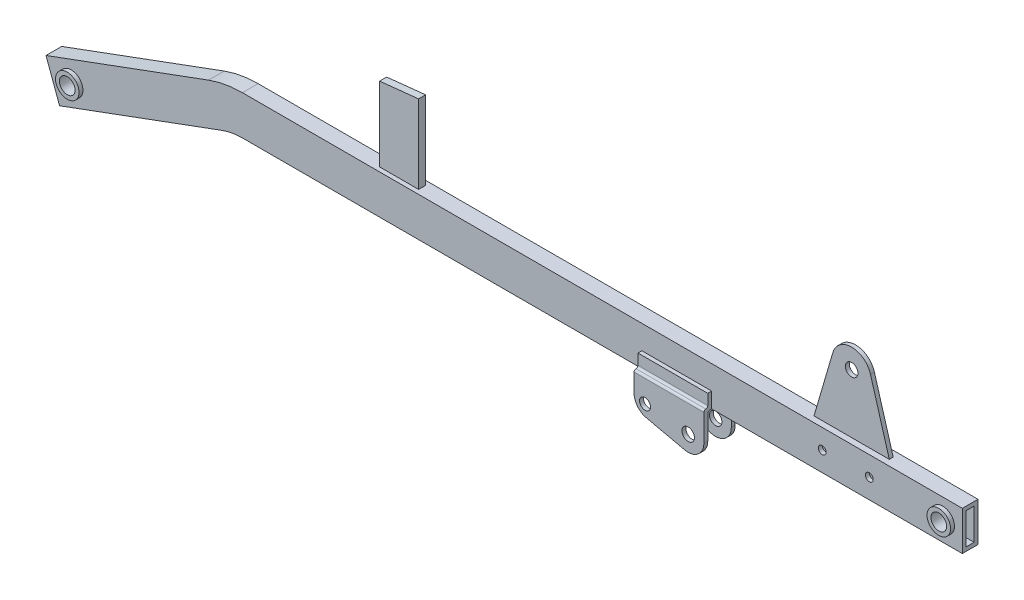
ISO-10303-21;
HEADER;
FILE_DESCRIPTION(('STEP AP214'),'2;1');
FILE_NAME('part.step','',(''),(''),'','','');
FILE_SCHEMA(('AUTOMOTIVE_DESIGN { 1 0 10303 214 1 1 1 1 }'));
ENDSEC;
DATA;
#1=APPLICATION_CONTEXT('core data for automotive mechanical design processes');
#2=APPLICATION_PROTOCOL_DEFINITION('international standard','automotive_design',2000,#1);
#3=PRODUCT_CONTEXT('',#1,'mechanical');
#4=PRODUCT('Part','Part','',(#3));
#5=PRODUCT_RELATED_PRODUCT_CATEGORY('part','',(#4));
#6=PRODUCT_DEFINITION_FORMATION('','',#4);
#7=PRODUCT_DEFINITION_CONTEXT('part definition',#1,'design');
#8=PRODUCT_DEFINITION('design','',#6,#7);
#9=PRODUCT_DEFINITION_SHAPE('','',#8);
#10=(LENGTH_UNIT() NAMED_UNIT(*) SI_UNIT(.MILLI.,.METRE.));
#11=(NAMED_UNIT(*) PLANE_ANGLE_UNIT() SI_UNIT($,.RADIAN.));
#12=(NAMED_UNIT(*) SI_UNIT($,.STERADIAN.) SOLID_ANGLE_UNIT());
#13=UNCERTAINTY_MEASURE_WITH_UNIT(LENGTH_MEASURE(1.E-05),#10,'distance_accuracy_value','');
#14=(GEOMETRIC_REPRESENTATION_CONTEXT(3) GLOBAL_UNCERTAINTY_ASSIGNED_CONTEXT((#13)) GLOBAL_UNIT_ASSIGNED_CONTEXT((#10,
#11,#12)) REPRESENTATION_CONTEXT('',''));
#15=CARTESIAN_POINT('',(0.,0.,0.));
#16=DIRECTION('',(0.,0.,1.));
#17=DIRECTION('',(1.,0.,0.));
#18=AXIS2_PLACEMENT_3D('',#15,#16,#17);
#19=CARTESIAN_POINT('',(616.340269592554,-5.30028362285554,-15.));
#20=DIRECTION('',(0.,0.,1.));
#21=DIRECTION('',(0.,-1.,0.));
#22=AXIS2_PLACEMENT_3D('',#19,#20,#21);
#23=PLANE('',#22);
#24=DIRECTION('',(0.,-1.,0.));
#25=VECTOR('',#24,1.);
#26=CARTESIAN_POINT('',(616.340269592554,-25.,-15.));
#27=LINE('',#26,#25);
#28=CARTESIAN_POINT('',(616.340269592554,-5.30028362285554,-15.));
#29=VERTEX_POINT('',#28);
#30=CARTESIAN_POINT('',(616.340269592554,-17.5,-15.));
#31=VERTEX_POINT('',#30);
#32=EDGE_CURVE('E420',#29,#31,#27,.T.);
#33=ORIENTED_EDGE('',*,*,#32,.T.);
#34=DIRECTION('',(1.,0.,0.));
#35=VECTOR('',#34,1.);
#36=CARTESIAN_POINT('',(527.340269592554,-17.5,-15.));
#37=LINE('',#36,#35);
#38=CARTESIAN_POINT('',(527.340269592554,-17.5,-15.));
#39=VERTEX_POINT('',#38);
#40=EDGE_CURVE('E445',#31,#39,#37,.F.);
#41=ORIENTED_EDGE('',*,*,#40,.T.);
#42=DIRECTION('',(0.,1.,0.));
#43=VECTOR('',#42,1.);
#44=CARTESIAN_POINT('',(527.340269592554,-25.,-15.));
#45=LINE('',#44,#43);
#46=CARTESIAN_POINT('',(527.340269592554,-5.30028362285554,-15.));
#47=VERTEX_POINT('',#46);
#48=EDGE_CURVE('E429',#39,#47,#45,.T.);
#49=ORIENTED_EDGE('',*,*,#48,.T.);
#50=DIRECTION('',(1.,0.,0.));
#51=VECTOR('',#50,1.);
#52=CARTESIAN_POINT('',(616.340269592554,-5.30028362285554,-15.));
#53=LINE('',#52,#51);
#54=EDGE_CURVE('E1585',#47,#29,#53,.T.);
#55=ORIENTED_EDGE('',*,*,#54,.T.);
#56=EDGE_LOOP('',(#33,#41,#49,#55));
#57=FACE_BOUND('',#56,.T.);
#58=ADVANCED_FACE('F31',(#57),#23,.F.);
#59=CARTESIAN_POINT('',(17.8475556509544,25.,-10.));
#60=DIRECTION('',(0.,0.,-1.));
#61=DIRECTION('',(0.,1.,0.));
#62=AXIS2_PLACEMENT_3D('',#59,#60,#61);
#63=PLANE('',#62);
#64=CARTESIAN_POINT('',(757.340269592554,0.,-10.));
#65=DIRECTION('',(0.,0.,-1.));
#66=DIRECTION('',(0.,1.,0.));
#67=AXIS2_PLACEMENT_3D('',#64,#65,#66);
#68=CIRCLE('',#67,5.00000000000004);
#69=CARTESIAN_POINT('',(762.340269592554,0.,-10.));
#70=VERTEX_POINT('',#69);
#71=EDGE_CURVE('E596',#70,#70,#68,.T.);
#72=ORIENTED_EDGE('',*,*,#71,.F.);
#73=EDGE_LOOP('',(#72));
#74=FACE_BOUND('',#73,.T.);
#75=CARTESIAN_POINT('',(817.340269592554,0.,-10.));
#76=DIRECTION('',(0.,0.,-1.));
#77=DIRECTION('',(0.,1.,0.));
#78=AXIS2_PLACEMENT_3D('',#75,#76,#77);
#79=CIRCLE('',#78,5.00000000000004);
#80=CARTESIAN_POINT('',(822.340269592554,0.,-10.));
#81=VERTEX_POINT('',#80);
#82=EDGE_CURVE('E363',#81,#81,#79,.T.);
#83=ORIENTED_EDGE('',*,*,#82,.F.);
#84=EDGE_LOOP('',(#83));
#85=FACE_BOUND('',#84,.T.);
#86=CARTESIAN_POINT('',(-200.553895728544,-73.9593789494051,-10.));
#87=DIRECTION('',(0.,0.,-1.));
#88=DIRECTION('',(0.,1.,0.));
#89=AXIS2_PLACEMENT_3D('',#86,#87,#88);
#90=CIRCLE('',#89,14.9999999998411);
#91=CARTESIAN_POINT('',(-200.553895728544,-58.959378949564,-10.));
#92=VERTEX_POINT('',#91);
#93=EDGE_CURVE('E619',#92,#92,#90,.F.);
#94=ORIENTED_EDGE('',*,*,#93,.T.);
#95=EDGE_LOOP('',(#94));
#96=FACE_BOUND('',#95,.T.);
#97=CARTESIAN_POINT('',(910.99,0.,-10.));
#98=DIRECTION('',(0.,0.,-1.));
#99=DIRECTION('',(0.,1.,0.));
#100=AXIS2_PLACEMENT_3D('',#97,#98,#99);
#101=CIRCLE('',#100,15.);
#102=CARTESIAN_POINT('',(910.99,15.,-10.));
#103=VERTEX_POINT('',#102);
#104=EDGE_CURVE('E623',#103,#103,#101,.F.);
#105=ORIENTED_EDGE('',*,*,#104,.T.);
#106=EDGE_LOOP('',(#105));
#107=FACE_BOUND('',#106,.T.);
#108=DIRECTION('',(1.,0.,0.));
#109=VECTOR('',#108,1.);
#110=CARTESIAN_POINT('',(17.8475556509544,-25.,-10.));
#111=LINE('',#110,#109);
#112=CARTESIAN_POINT('',(616.340269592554,-25.,-10.));
#113=VERTEX_POINT('',#112);
#114=CARTESIAN_POINT('',(935.99,-25.,-10.));
#115=VERTEX_POINT('',#114);
#116=EDGE_CURVE('E627',#113,#115,#111,.T.);
#117=ORIENTED_EDGE('',*,*,#116,.F.);
#118=DIRECTION('',(0.,-1.,0.));
#119=VECTOR('',#118,1.);
#120=CARTESIAN_POINT('',(616.340269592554,-25.,-10.));
#121=LINE('',#120,#119);
#122=CARTESIAN_POINT('',(616.340269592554,-5.30028362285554,-10.));
#123=VERTEX_POINT('',#122);
#124=EDGE_CURVE('E412',#123,#113,#121,.T.);
#125=ORIENTED_EDGE('',*,*,#124,.F.);
#126=DIRECTION('',(1.,0.,0.));
#127=VECTOR('',#126,1.);
#128=CARTESIAN_POINT('',(616.340269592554,-5.30028362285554,-10.));
#129=LINE('',#128,#127);
#130=CARTESIAN_POINT('',(527.340269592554,-5.30028362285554,-10.));
#131=VERTEX_POINT('',#130);
#132=EDGE_CURVE('E418',#131,#123,#129,.T.);
#133=ORIENTED_EDGE('',*,*,#132,.F.);
#134=DIRECTION('',(0.,1.,0.));
#135=VECTOR('',#134,1.);
#136=CARTESIAN_POINT('',(527.340269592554,-25.,-10.));
#137=LINE('',#136,#135);
#138=CARTESIAN_POINT('',(527.340269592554,-25.,-10.));
#139=VERTEX_POINT('',#138);
#140=EDGE_CURVE('E415',#139,#131,#137,.T.);
#141=ORIENTED_EDGE('',*,*,#140,.F.);
#142=CARTESIAN_POINT('',(17.8475556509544,-25.,-10.));
#143=VERTEX_POINT('',#142);
#144=EDGE_CURVE('E634',#143,#139,#111,.T.);
#145=ORIENTED_EDGE('',*,*,#144,.F.);
#146=CARTESIAN_POINT('',(17.8511990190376,-100.,-10.));
#147=DIRECTION('',(0.,0.,1.));
#148=DIRECTION('',(1.,0.,0.));
#149=AXIS2_PLACEMENT_3D('',#146,#147,#148);
#150=CIRCLE('',#149,75.0000000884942);
#151=CARTESIAN_POINT('',(-8.10208563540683,-29.6336228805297,-10.));
#152=VERTEX_POINT('',#151);
#153=EDGE_CURVE('E686',#143,#152,#150,.T.);
#154=ORIENTED_EDGE('',*,*,#153,.T.);
#155=DIRECTION('',(-0.938235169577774,-0.345998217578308,0.));
#156=VECTOR('',#155,1.);
#157=CARTESIAN_POINT('',(-8.10208563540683,-29.6336228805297,-10.));
#158=LINE('',#157,#156);
#159=CARTESIAN_POINT('',(-215.35981952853,-106.065213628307,-10.));
#160=VERTEX_POINT('',#159);
#161=EDGE_CURVE('E730',#152,#160,#158,.T.);
#162=ORIENTED_EDGE('',*,*,#161,.T.);
#163=DIRECTION('',(-0.345998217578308,0.938235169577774,0.));
#164=VECTOR('',#163,1.);
#165=CARTESIAN_POINT('',(-232.659730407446,-59.1534551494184,-10.));
#166=LINE('',#165,#164);
#167=CARTESIAN_POINT('',(-232.659730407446,-59.1534551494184,-10.));
#168=VERTEX_POINT('',#167);
#169=EDGE_CURVE('E713',#160,#168,#166,.T.);
#170=ORIENTED_EDGE('',*,*,#169,.T.);
#171=DIRECTION('',(-0.938235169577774,-0.345998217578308,0.));
#172=VECTOR('',#171,1.);
#173=CARTESIAN_POINT('',(-25.4019965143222,17.278135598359,-10.));
#174=LINE('',#173,#172);
#175=CARTESIAN_POINT('',(-25.4019965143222,17.278135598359,-10.));
#176=VERTEX_POINT('',#175);
#177=EDGE_CURVE('E733',#176,#168,#174,.T.);
#178=ORIENTED_EDGE('',*,*,#177,.F.);
#179=CARTESIAN_POINT('',(17.8511990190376,-100.,-10.));
#180=DIRECTION('',(0.,0.,1.));
#181=DIRECTION('',(1.,0.,0.));
#182=AXIS2_PLACEMENT_3D('',#179,#180,#181);
#183=CIRCLE('',#182,125.000000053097);
#184=CARTESIAN_POINT('',(17.8475556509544,25.,-10.));
#185=VERTEX_POINT('',#184);
#186=EDGE_CURVE('E689',#185,#176,#183,.T.);
#187=ORIENTED_EDGE('',*,*,#186,.F.);
#188=DIRECTION('',(1.,0.,0.));
#189=VECTOR('',#188,1.);
#190=CARTESIAN_POINT('',(17.8475556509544,25.,-10.));
#191=LINE('',#190,#189);
#192=CARTESIAN_POINT('',(935.99,25.,-10.));
#193=VERTEX_POINT('',#192);
#194=EDGE_CURVE('E638',#185,#193,#191,.T.);
#195=ORIENTED_EDGE('',*,*,#194,.T.);
#196=DIRECTION('',(0.,1.,0.));
#197=VECTOR('',#196,1.);
#198=CARTESIAN_POINT('',(935.99,25.,-10.));
#199=LINE('',#198,#197);
#200=EDGE_CURVE('E630',#115,#193,#199,.T.);
#201=ORIENTED_EDGE('',*,*,#200,.F.);
#202=EDGE_LOOP('',(#117,#125,#133,#141,#145,#154,#162,#170,#178,#187,#195,#201));
#203=FACE_BOUND('',#202,.T.);
#204=ADVANCED_FACE('F610',(#74,#85,#96,#107,#203),#63,.T.);
#205=CARTESIAN_POINT('',(547.340269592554,-46.9939589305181,20.));
#206=DIRECTION('',(0.,0.,-1.));
#207=DIRECTION('',(-1.,0.,0.));
#208=AXIS2_PLACEMENT_3D('',#205,#206,#207);
#209=PLANE('',#208);
#210=CARTESIAN_POINT('',(541.340269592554,-51.9999999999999,20.));
#211=DIRECTION('',(0.,0.,1.));
#212=DIRECTION('',(1.,0.,0.));
#213=AXIS2_PLACEMENT_3D('',#210,#211,#212);
#214=CIRCLE('',#213,6.99999999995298);
#215=CARTESIAN_POINT('',(548.340269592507,-51.9999999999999,20.));
#216=VERTEX_POINT('',#215);
#217=EDGE_CURVE('E754',#216,#216,#214,.T.);
#218=ORIENTED_EDGE('',*,*,#217,.F.);
#219=EDGE_LOOP('',(#218));
#220=FACE_BOUND('',#219,.T.);
#221=DIRECTION('',(0.,1.,0.));
#222=VECTOR('',#221,1.);
#223=CARTESIAN_POINT('',(616.340269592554,-57.9999999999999,20.));
#224=LINE('',#223,#222);
#225=CARTESIAN_POINT('',(616.340269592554,-57.9999999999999,20.));
#226=VERTEX_POINT('',#225);
#227=CARTESIAN_POINT('',(616.340269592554,-23.8578588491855,20.));
#228=VERTEX_POINT('',#227);
#229=EDGE_CURVE('E480',#226,#228,#224,.T.);
#230=ORIENTED_EDGE('',*,*,#229,.T.);
#231=DIRECTION('',(-1.,0.,0.));
#232=VECTOR('',#231,1.);
#233=CARTESIAN_POINT('',(547.340269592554,-23.8578588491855,20.));
#234=LINE('',#233,#232);
#235=CARTESIAN_POINT('',(527.340269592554,-23.8578588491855,20.));
#236=VERTEX_POINT('',#235);
#237=EDGE_CURVE('E749',#228,#236,#234,.T.);
#238=ORIENTED_EDGE('',*,*,#237,.T.);
#239=DIRECTION('',(0.,-1.,0.));
#240=VECTOR('',#239,1.);
#241=CARTESIAN_POINT('',(527.340269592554,-21.3578588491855,20.));
#242=LINE('',#241,#240);
#243=CARTESIAN_POINT('',(527.340269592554,-46.9939589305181,20.));
#244=VERTEX_POINT('',#243);
#245=EDGE_CURVE('E465',#236,#244,#242,.T.);
#246=ORIENTED_EDGE('',*,*,#245,.T.);
#247=CARTESIAN_POINT('',(547.340269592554,-46.9939589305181,20.));
#248=DIRECTION('',(0.,0.,1.));
#249=DIRECTION('',(-1.,0.,0.));
#250=AXIS2_PLACEMENT_3D('',#247,#248,#249);
#251=CIRCLE('',#250,20.);
#252=CARTESIAN_POINT('',(542.957212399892,-66.5077696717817,20.));
#253=VERTEX_POINT('',#252);
#254=EDGE_CURVE('E474',#244,#253,#251,.T.);
#255=ORIENTED_EDGE('',*,*,#254,.T.);
#256=DIRECTION('',(0.975690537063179,-0.219152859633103,0.));
#257=VECTOR('',#256,1.);
#258=CARTESIAN_POINT('',(542.957212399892,-66.5077696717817,20.));
#259=LINE('',#258,#257);
#260=CARTESIAN_POINT('',(591.957212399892,-77.5138107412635,20.));
#261=VERTEX_POINT('',#260);
#262=EDGE_CURVE('E476',#253,#261,#259,.T.);
#263=ORIENTED_EDGE('',*,*,#262,.T.);
#264=CARTESIAN_POINT('',(596.340269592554,-57.9999999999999,20.));
#265=DIRECTION('',(0.,0.,1.));
#266=DIRECTION('',(-1.,0.,0.));
#267=AXIS2_PLACEMENT_3D('',#264,#265,#266);
#268=CIRCLE('',#267,20.);
#269=EDGE_CURVE('E478',#261,#226,#268,.T.);
#270=ORIENTED_EDGE('',*,*,#269,.T.);
#271=EDGE_LOOP('',(#230,#238,#246,#255,#263,#270));
#272=FACE_BOUND('',#271,.T.);
#273=CARTESIAN_POINT('',(596.340269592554,-57.9999999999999,20.));
#274=DIRECTION('',(0.,0.,1.));
#275=DIRECTION('',(1.,0.,0.));
#276=AXIS2_PLACEMENT_3D('',#273,#274,#275);
#277=CIRCLE('',#276,7.99999999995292);
#278=CARTESIAN_POINT('',(604.340269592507,-57.9999999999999,20.));
#279=VERTEX_POINT('',#278);
#280=EDGE_CURVE('E1610',#279,#279,#277,.T.);
#281=ORIENTED_EDGE('',*,*,#280,.F.);
#282=EDGE_LOOP('',(#281));
#283=FACE_BOUND('',#282,.T.);
#284=ADVANCED_FACE('F613',(#220,#272,#283),#209,.F.);
#285=CARTESIAN_POINT('',(547.340269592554,-46.9939589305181,15.));
#286=DIRECTION('',(0.,0.,-1.));
#287=DIRECTION('',(-1.,0.,0.));
#288=AXIS2_PLACEMENT_3D('',#285,#286,#287);
#289=PLANE('',#288);
#290=DIRECTION('',(0.,-1.,0.));
#291=VECTOR('',#290,1.);
#292=CARTESIAN_POINT('',(527.340269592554,-24.9999999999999,15.));
#293=LINE('',#292,#291);
#294=CARTESIAN_POINT('',(527.340269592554,-27.5,15.));
#295=VERTEX_POINT('',#294);
#296=CARTESIAN_POINT('',(527.340269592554,-46.9939589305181,15.));
#297=VERTEX_POINT('',#296);
#298=EDGE_CURVE('E750',#295,#297,#293,.T.);
#299=ORIENTED_EDGE('',*,*,#298,.F.);
#300=DIRECTION('',(-1.,0.,0.));
#301=VECTOR('',#300,1.);
#302=CARTESIAN_POINT('',(547.340269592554,-27.5,15.));
#303=LINE('',#302,#301);
#304=CARTESIAN_POINT('',(616.340269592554,-27.5,15.));
#305=VERTEX_POINT('',#304);
#306=EDGE_CURVE('E777',#295,#305,#303,.F.);
#307=ORIENTED_EDGE('',*,*,#306,.T.);
#308=DIRECTION('',(0.,1.,0.));
#309=VECTOR('',#308,1.);
#310=CARTESIAN_POINT('',(616.340269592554,-57.9999999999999,15.));
#311=LINE('',#310,#309);
#312=CARTESIAN_POINT('',(616.340269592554,-57.9999999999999,15.));
#313=VERTEX_POINT('',#312);
#314=EDGE_CURVE('E461',#313,#305,#311,.T.);
#315=ORIENTED_EDGE('',*,*,#314,.F.);
#316=CARTESIAN_POINT('',(596.340269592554,-57.9999999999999,15.));
#317=DIRECTION('',(0.,0.,1.));
#318=DIRECTION('',(-1.,0.,0.));
#319=AXIS2_PLACEMENT_3D('',#316,#317,#318);
#320=CIRCLE('',#319,20.);
#321=CARTESIAN_POINT('',(591.957212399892,-77.5138107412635,15.));
#322=VERTEX_POINT('',#321);
#323=EDGE_CURVE('E466',#322,#313,#320,.T.);
#324=ORIENTED_EDGE('',*,*,#323,.F.);
#325=DIRECTION('',(0.975690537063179,-0.219152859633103,0.));
#326=VECTOR('',#325,1.);
#327=CARTESIAN_POINT('',(542.957212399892,-66.5077696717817,15.));
#328=LINE('',#327,#326);
#329=CARTESIAN_POINT('',(542.957212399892,-66.5077696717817,15.));
#330=VERTEX_POINT('',#329);
#331=EDGE_CURVE('E761',#330,#322,#328,.T.);
#332=ORIENTED_EDGE('',*,*,#331,.F.);
#333=CARTESIAN_POINT('',(547.340269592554,-46.9939589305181,15.));
#334=DIRECTION('',(0.,0.,1.));
#335=DIRECTION('',(-1.,0.,0.));
#336=AXIS2_PLACEMENT_3D('',#333,#334,#335);
#337=CIRCLE('',#336,20.);
#338=EDGE_CURVE('E753',#297,#330,#337,.T.);
#339=ORIENTED_EDGE('',*,*,#338,.F.);
#340=EDGE_LOOP('',(#299,#307,#315,#324,#332,#339));
#341=FACE_BOUND('',#340,.T.);
#342=CARTESIAN_POINT('',(541.340269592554,-51.9999999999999,15.));
#343=DIRECTION('',(0.,0.,1.));
#344=DIRECTION('',(1.,0.,0.));
#345=AXIS2_PLACEMENT_3D('',#342,#343,#344);
#346=CIRCLE('',#345,6.99999999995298);
#347=CARTESIAN_POINT('',(548.340269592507,-51.9999999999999,15.));
#348=VERTEX_POINT('',#347);
#349=EDGE_CURVE('E1611',#348,#348,#346,.T.);
#350=ORIENTED_EDGE('',*,*,#349,.T.);
#351=EDGE_LOOP('',(#350));
#352=FACE_BOUND('',#351,.T.);
#353=CARTESIAN_POINT('',(596.340269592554,-57.9999999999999,15.));
#354=DIRECTION('',(0.,0.,1.));
#355=DIRECTION('',(1.,0.,0.));
#356=AXIS2_PLACEMENT_3D('',#353,#354,#355);
#357=CIRCLE('',#356,7.99999999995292);
#358=CARTESIAN_POINT('',(604.340269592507,-57.9999999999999,15.));
#359=VERTEX_POINT('',#358);
#360=EDGE_CURVE('E814',#359,#359,#357,.T.);
#361=ORIENTED_EDGE('',*,*,#360,.T.);
#362=EDGE_LOOP('',(#361));
#363=FACE_BOUND('',#362,.T.);
#364=ADVANCED_FACE('F774',(#341,#352,#363),#289,.T.);
#365=CARTESIAN_POINT('',(527.340269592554,-24.9999999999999,20.));
#366=DIRECTION('',(1.,0.,0.));
#367=DIRECTION('',(0.,0.,-1.));
#368=AXIS2_PLACEMENT_3D('',#365,#366,#367);
#369=PLANE('',#368);
#370=ORIENTED_EDGE('',*,*,#245,.F.);
#371=CARTESIAN_POINT('',(527.340269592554,-23.8578588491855,17.5));
#372=DIRECTION('',(1.,0.,0.));
#373=DIRECTION('',(0.,0.,-1.));
#374=AXIS2_PLACEMENT_3D('',#371,#372,#373);
#375=CIRCLE('',#374,2.5);
#376=CARTESIAN_POINT('',(527.340269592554,-21.3578588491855,17.5));
#377=VERTEX_POINT('',#376);
#378=EDGE_CURVE('E755',#236,#377,#375,.F.);
#379=ORIENTED_EDGE('',*,*,#378,.T.);
#380=CARTESIAN_POINT('',(527.340269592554,-18.8578588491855,17.5));
#381=DIRECTION('',(1.,0.,0.));
#382=DIRECTION('',(0.,0.,-1.));
#383=AXIS2_PLACEMENT_3D('',#380,#381,#382);
#384=CIRCLE('',#383,2.5);
#385=CARTESIAN_POINT('',(527.340269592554,-18.8578588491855,15.));
#386=VERTEX_POINT('',#385);
#387=EDGE_CURVE('E40',#377,#386,#384,.T.);
#388=ORIENTED_EDGE('',*,*,#387,.T.);
#389=DIRECTION('',(0.,1.,0.));
#390=VECTOR('',#389,1.);
#391=CARTESIAN_POINT('',(527.340269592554,-25.,15.));
#392=LINE('',#391,#390);
#393=CARTESIAN_POINT('',(527.340269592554,-5.30028362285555,15.));
#394=VERTEX_POINT('',#393);
#395=EDGE_CURVE('E745',#386,#394,#392,.T.);
#396=ORIENTED_EDGE('',*,*,#395,.T.);
#397=DIRECTION('',(0.,0.,-1.));
#398=VECTOR('',#397,1.);
#399=CARTESIAN_POINT('',(527.340269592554,-5.30028362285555,106.154148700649));
#400=LINE('',#399,#398);
#401=CARTESIAN_POINT('',(527.340269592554,-5.30028362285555,10.));
#402=VERTEX_POINT('',#401);
#403=EDGE_CURVE('E457',#394,#402,#400,.T.);
#404=ORIENTED_EDGE('',*,*,#403,.T.);
#405=DIRECTION('',(0.,-1.,0.));
#406=VECTOR('',#405,1.);
#407=CARTESIAN_POINT('',(527.340269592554,-25.,10.));
#408=LINE('',#407,#406);
#409=CARTESIAN_POINT('',(527.340269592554,-25.,10.));
#410=VERTEX_POINT('',#409);
#411=EDGE_CURVE('E455',#402,#410,#408,.T.);
#412=ORIENTED_EDGE('',*,*,#411,.T.);
#413=DIRECTION('',(0.,0.,-1.));
#414=VECTOR('',#413,1.);
#415=CARTESIAN_POINT('',(527.340269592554,-25.,106.154148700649));
#416=LINE('',#415,#414);
#417=CARTESIAN_POINT('',(527.340269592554,-25.,12.5));
#418=VERTEX_POINT('',#417);
#419=EDGE_CURVE('E454',#418,#410,#416,.T.);
#420=ORIENTED_EDGE('',*,*,#419,.F.);
#421=CARTESIAN_POINT('',(527.340269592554,-27.5,12.5));
#422=DIRECTION('',(1.,0.,0.));
#423=DIRECTION('',(0.,0.,-1.));
#424=AXIS2_PLACEMENT_3D('',#421,#422,#423);
#425=CIRCLE('',#424,2.5);
#426=EDGE_CURVE('E583',#418,#295,#425,.T.);
#427=ORIENTED_EDGE('',*,*,#426,.T.);
#428=ORIENTED_EDGE('',*,*,#298,.T.);
#429=DIRECTION('',(0.,0.,-1.));
#430=VECTOR('',#429,1.);
#431=CARTESIAN_POINT('',(527.340269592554,-46.9939589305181,20.));
#432=LINE('',#431,#430);
#433=EDGE_CURVE('E467',#244,#297,#432,.T.);
#434=ORIENTED_EDGE('',*,*,#433,.F.);
#435=EDGE_LOOP('',(#370,#379,#388,#396,#404,#412,#420,#427,#428,#434));
#436=FACE_BOUND('',#435,.T.);
#437=ADVANCED_FACE('F33',(#436),#369,.F.);
#438=CARTESIAN_POINT('',(547.340269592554,-46.9939589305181,20.));
#439=DIRECTION('',(0.,0.,-1.));
#440=DIRECTION('',(-1.,0.,0.));
#441=AXIS2_PLACEMENT_3D('',#438,#439,#440);
#442=CYLINDRICAL_SURFACE('',#441,20.);
#443=ORIENTED_EDGE('',*,*,#338,.T.);
#444=DIRECTION('',(0.,0.,-1.));
#445=VECTOR('',#444,1.);
#446=CARTESIAN_POINT('',(542.957212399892,-66.5077696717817,20.));
#447=LINE('',#446,#445);
#448=EDGE_CURVE('E488',#253,#330,#447,.T.);
#449=ORIENTED_EDGE('',*,*,#448,.F.);
#450=ORIENTED_EDGE('',*,*,#254,.F.);
#451=ORIENTED_EDGE('',*,*,#433,.T.);
#452=EDGE_LOOP('',(#443,#449,#450,#451));
#453=FACE_BOUND('',#452,.T.);
#454=ADVANCED_FACE('F1160',(#453),#442,.T.);
#455=CARTESIAN_POINT('',(542.957212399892,-66.5077696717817,20.));
#456=DIRECTION('',(0.219152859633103,0.975690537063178,0.));
#457=DIRECTION('',(-0.975690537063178,0.219152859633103,0.));
#458=AXIS2_PLACEMENT_3D('',#455,#456,#457);
#459=PLANE('',#458);
#460=ORIENTED_EDGE('',*,*,#331,.T.);
#461=DIRECTION('',(0.,0.,-1.));
#462=VECTOR('',#461,1.);
#463=CARTESIAN_POINT('',(591.957212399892,-77.5138107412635,20.));
#464=LINE('',#463,#462);
#465=EDGE_CURVE('E486',#261,#322,#464,.T.);
#466=ORIENTED_EDGE('',*,*,#465,.F.);
#467=ORIENTED_EDGE('',*,*,#262,.F.);
#468=ORIENTED_EDGE('',*,*,#448,.T.);
#469=EDGE_LOOP('',(#460,#466,#467,#468));
#470=FACE_BOUND('',#469,.T.);
#471=ADVANCED_FACE('F1158',(#470),#459,.F.);
#472=CARTESIAN_POINT('',(596.340269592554,-57.9999999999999,20.));
#473=DIRECTION('',(0.,0.,-1.));
#474=DIRECTION('',(-1.,0.,0.));
#475=AXIS2_PLACEMENT_3D('',#472,#473,#474);
#476=CYLINDRICAL_SURFACE('',#475,20.);
#477=ORIENTED_EDGE('',*,*,#323,.T.);
#478=DIRECTION('',(0.,0.,-1.));
#479=VECTOR('',#478,1.);
#480=CARTESIAN_POINT('',(616.340269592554,-57.9999999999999,20.));
#481=LINE('',#480,#479);
#482=EDGE_CURVE('E483',#226,#313,#481,.T.);
#483=ORIENTED_EDGE('',*,*,#482,.F.);
#484=ORIENTED_EDGE('',*,*,#269,.F.);
#485=ORIENTED_EDGE('',*,*,#465,.T.);
#486=EDGE_LOOP('',(#477,#483,#484,#485));
#487=FACE_BOUND('',#486,.T.);
#488=ADVANCED_FACE('F766',(#487),#476,.T.);
#489=CARTESIAN_POINT('',(616.340269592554,-57.9999999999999,20.));
#490=DIRECTION('',(-1.,0.,0.));
#491=DIRECTION('',(0.,0.,1.));
#492=AXIS2_PLACEMENT_3D('',#489,#490,#491);
#493=PLANE('',#492);
#494=DIRECTION('',(0.,-1.,0.));
#495=VECTOR('',#494,1.);
#496=CARTESIAN_POINT('',(616.340269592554,-25.,15.));
#497=LINE('',#496,#495);
#498=CARTESIAN_POINT('',(616.340269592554,-5.30028362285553,15.));
#499=VERTEX_POINT('',#498);
#500=CARTESIAN_POINT('',(616.340269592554,-18.8578588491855,15.));
#501=VERTEX_POINT('',#500);
#502=EDGE_CURVE('E812',#499,#501,#497,.T.);
#503=ORIENTED_EDGE('',*,*,#502,.T.);
#504=CARTESIAN_POINT('',(616.340269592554,-18.8578588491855,17.5));
#505=DIRECTION('',(-1.,0.,0.));
#506=DIRECTION('',(0.,0.,1.));
#507=AXIS2_PLACEMENT_3D('',#504,#505,#506);
#508=CIRCLE('',#507,2.5);
#509=CARTESIAN_POINT('',(616.340269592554,-21.3578588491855,17.5));
#510=VERTEX_POINT('',#509);
#511=EDGE_CURVE('E11',#501,#510,#508,.T.);
#512=ORIENTED_EDGE('',*,*,#511,.T.);
#513=CARTESIAN_POINT('',(616.340269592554,-23.8578588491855,17.5));
#514=DIRECTION('',(-1.,0.,0.));
#515=DIRECTION('',(0.,0.,1.));
#516=AXIS2_PLACEMENT_3D('',#513,#514,#515);
#517=CIRCLE('',#516,2.5);
#518=EDGE_CURVE('E779',#510,#228,#517,.F.);
#519=ORIENTED_EDGE('',*,*,#518,.T.);
#520=ORIENTED_EDGE('',*,*,#229,.F.);
#521=ORIENTED_EDGE('',*,*,#482,.T.);
#522=ORIENTED_EDGE('',*,*,#314,.T.);
#523=CARTESIAN_POINT('',(616.340269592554,-27.5,12.5));
#524=DIRECTION('',(-1.,0.,0.));
#525=DIRECTION('',(0.,0.,1.));
#526=AXIS2_PLACEMENT_3D('',#523,#524,#525);
#527=CIRCLE('',#526,2.5);
#528=CARTESIAN_POINT('',(616.340269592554,-25.,12.5));
#529=VERTEX_POINT('',#528);
#530=EDGE_CURVE('E585',#305,#529,#527,.T.);
#531=ORIENTED_EDGE('',*,*,#530,.T.);
#532=DIRECTION('',(0.,0.,-1.));
#533=VECTOR('',#532,1.);
#534=CARTESIAN_POINT('',(616.340269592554,-25.,106.154148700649));
#535=LINE('',#534,#533);
#536=CARTESIAN_POINT('',(616.340269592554,-25.,10.));
#537=VERTEX_POINT('',#536);
#538=EDGE_CURVE('E452',#529,#537,#535,.T.);
#539=ORIENTED_EDGE('',*,*,#538,.T.);
#540=DIRECTION('',(0.,1.,0.));
#541=VECTOR('',#540,1.);
#542=CARTESIAN_POINT('',(616.340269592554,-25.,10.));
#543=LINE('',#542,#541);
#544=CARTESIAN_POINT('',(616.340269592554,-5.30028362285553,10.));
#545=VERTEX_POINT('',#544);
#546=EDGE_CURVE('E739',#537,#545,#543,.T.);
#547=ORIENTED_EDGE('',*,*,#546,.T.);
#548=DIRECTION('',(0.,0.,-1.));
#549=VECTOR('',#548,1.);
#550=CARTESIAN_POINT('',(616.340269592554,-5.30028362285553,106.154148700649));
#551=LINE('',#550,#549);
#552=EDGE_CURVE('E748',#499,#545,#551,.T.);
#553=ORIENTED_EDGE('',*,*,#552,.F.);
#554=EDGE_LOOP('',(#503,#512,#519,#520,#521,#522,#531,#539,#547,#553));
#555=FACE_BOUND('',#554,.T.);
#556=ADVANCED_FACE('F771',(#555),#493,.F.);
#557=CARTESIAN_POINT('',(541.340269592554,-51.9999999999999,20.));
#558=DIRECTION('',(0.,0.,-1.));
#559=DIRECTION('',(-1.,0.,0.));
#560=AXIS2_PLACEMENT_3D('',#557,#558,#559);
#561=CYLINDRICAL_SURFACE('',#560,6.99999999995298);
#562=ORIENTED_EDGE('',*,*,#217,.T.);
#563=EDGE_LOOP('',(#562));
#564=FACE_BOUND('',#563,.T.);
#565=ORIENTED_EDGE('',*,*,#349,.F.);
#566=EDGE_LOOP('',(#565));
#567=FACE_BOUND('',#566,.T.);
#568=ADVANCED_FACE('F1145',(#564,#567),#561,.F.);
#569=CARTESIAN_POINT('',(596.340269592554,-57.9999999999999,20.));
#570=DIRECTION('',(0.,0.,-1.));
#571=DIRECTION('',(-1.,0.,0.));
#572=AXIS2_PLACEMENT_3D('',#569,#570,#571);
#573=CYLINDRICAL_SURFACE('',#572,7.99999999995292);
#574=ORIENTED_EDGE('',*,*,#280,.T.);
#575=EDGE_LOOP('',(#574));
#576=FACE_BOUND('',#575,.T.);
#577=ORIENTED_EDGE('',*,*,#360,.F.);
#578=EDGE_LOOP('',(#577));
#579=FACE_BOUND('',#578,.T.);
#580=ADVANCED_FACE('F1139',(#576,#579),#573,.F.);
#581=CARTESIAN_POINT('',(616.340269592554,-25.,106.154148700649));
#582=DIRECTION('',(0.,1.,0.));
#583=DIRECTION('',(-1.,0.,0.));
#584=AXIS2_PLACEMENT_3D('',#581,#582,#583);
#585=PLANE('',#584);
#586=DIRECTION('',(0.,0.,1.));
#587=VECTOR('',#586,1.);
#588=CARTESIAN_POINT('',(527.340269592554,-25.,-15.));
#589=LINE('',#588,#587);
#590=CARTESIAN_POINT('',(527.340269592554,-25.,-12.5));
#591=VERTEX_POINT('',#590);
#592=EDGE_CURVE('E437',#591,#139,#589,.T.);
#593=ORIENTED_EDGE('',*,*,#592,.F.);
#594=DIRECTION('',(-1.,0.,0.));
#595=VECTOR('',#594,1.);
#596=CARTESIAN_POINT('',(616.340269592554,-25.,-12.5));
#597=LINE('',#596,#595);
#598=CARTESIAN_POINT('',(616.340269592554,-25.,-12.5));
#599=VERTEX_POINT('',#598);
#600=EDGE_CURVE('E786',#591,#599,#597,.F.);
#601=ORIENTED_EDGE('',*,*,#600,.T.);
#602=DIRECTION('',(0.,0.,1.));
#603=VECTOR('',#602,1.);
#604=CARTESIAN_POINT('',(616.340269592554,-25.,-15.));
#605=LINE('',#604,#603);
#606=EDGE_CURVE('E440',#599,#113,#605,.T.);
#607=ORIENTED_EDGE('',*,*,#606,.T.);
#608=ORIENTED_EDGE('',*,*,#116,.T.);
#609=DIRECTION('',(0.,0.,-1.));
#610=VECTOR('',#609,1.);
#611=CARTESIAN_POINT('',(935.99,-25.,10.));
#612=LINE('',#611,#610);
#613=CARTESIAN_POINT('',(935.99,-25.,10.));
#614=VERTEX_POINT('',#613);
#615=EDGE_CURVE('E823',#614,#115,#612,.T.);
#616=ORIENTED_EDGE('',*,*,#615,.F.);
#617=DIRECTION('',(1.,0.,0.));
#618=VECTOR('',#617,1.);
#619=CARTESIAN_POINT('',(17.8475556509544,-25.,10.));
#620=LINE('',#619,#618);
#621=EDGE_CURVE('E640',#537,#614,#620,.T.);
#622=ORIENTED_EDGE('',*,*,#621,.F.);
#623=ORIENTED_EDGE('',*,*,#538,.F.);
#624=DIRECTION('',(-1.,0.,0.));
#625=VECTOR('',#624,1.);
#626=CARTESIAN_POINT('',(616.340269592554,-25.,12.5));
#627=LINE('',#626,#625);
#628=EDGE_CURVE('E451',#529,#418,#627,.T.);
#629=ORIENTED_EDGE('',*,*,#628,.T.);
#630=ORIENTED_EDGE('',*,*,#419,.T.);
#631=CARTESIAN_POINT('',(17.8475556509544,-25.,10.));
#632=VERTEX_POINT('',#631);
#633=EDGE_CURVE('E635',#632,#410,#620,.T.);
#634=ORIENTED_EDGE('',*,*,#633,.F.);
#635=DIRECTION('',(0.,0.,-1.));
#636=VECTOR('',#635,1.);
#637=CARTESIAN_POINT('',(17.8475556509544,-25.,10.));
#638=LINE('',#637,#636);
#639=EDGE_CURVE('E847',#632,#143,#638,.T.);
#640=ORIENTED_EDGE('',*,*,#639,.T.);
#641=ORIENTED_EDGE('',*,*,#144,.T.);
#642=EDGE_LOOP('',(#593,#601,#607,#608,#616,#622,#623,#629,#630,#634,#640,#641));
#643=FACE_BOUND('',#642,.T.);
#644=ADVANCED_FACE('F796',(#643),#585,.F.);
#645=CARTESIAN_POINT('',(616.340269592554,-5.30028362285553,106.154148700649));
#646=DIRECTION('',(0.,-1.,0.));
#647=DIRECTION('',(1.,0.,0.));
#648=AXIS2_PLACEMENT_3D('',#645,#646,#647);
#649=PLANE('',#648);
#650=ORIENTED_EDGE('',*,*,#403,.F.);
#651=DIRECTION('',(1.,0.,0.));
#652=VECTOR('',#651,1.);
#653=CARTESIAN_POINT('',(616.340269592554,-5.30028362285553,15.));
#654=LINE('',#653,#652);
#655=EDGE_CURVE('E742',#394,#499,#654,.T.);
#656=ORIENTED_EDGE('',*,*,#655,.T.);
#657=ORIENTED_EDGE('',*,*,#552,.T.);
#658=DIRECTION('',(-1.,0.,0.));
#659=VECTOR('',#658,1.);
#660=CARTESIAN_POINT('',(616.340269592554,-5.30028362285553,10.));
#661=LINE('',#660,#659);
#662=EDGE_CURVE('E804',#545,#402,#661,.T.);
#663=ORIENTED_EDGE('',*,*,#662,.T.);
#664=EDGE_LOOP('',(#650,#656,#657,#663));
#665=FACE_BOUND('',#664,.T.);
#666=ADVANCED_FACE('F1064',(#665),#649,.F.);
#667=CARTESIAN_POINT('',(547.340269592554,-46.9939589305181,15.));
#668=DIRECTION('',(0.,0.,-1.));
#669=DIRECTION('',(-1.,0.,0.));
#670=AXIS2_PLACEMENT_3D('',#667,#668,#669);
#671=PLANE('',#670);
#672=ORIENTED_EDGE('',*,*,#395,.F.);
#673=DIRECTION('',(-1.,0.,0.));
#674=VECTOR('',#673,1.);
#675=CARTESIAN_POINT('',(616.340269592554,-18.8578588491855,15.));
#676=LINE('',#675,#674);
#677=EDGE_CURVE('E569',#386,#501,#676,.F.);
#678=ORIENTED_EDGE('',*,*,#677,.T.);
#679=ORIENTED_EDGE('',*,*,#502,.F.);
#680=ORIENTED_EDGE('',*,*,#655,.F.);
#681=EDGE_LOOP('',(#672,#678,#679,#680));
#682=FACE_BOUND('',#681,.T.);
#683=ADVANCED_FACE('F1059',(#682),#671,.F.);
#684=CARTESIAN_POINT('',(17.8475556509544,25.,10.));
#685=DIRECTION('',(0.,0.,1.));
#686=DIRECTION('',(0.,-1.,0.));
#687=AXIS2_PLACEMENT_3D('',#684,#685,#686);
#688=PLANE('',#687);
#689=CARTESIAN_POINT('',(757.340269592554,0.,10.));
#690=DIRECTION('',(0.,0.,1.));
#691=DIRECTION('',(1.,0.,0.));
#692=AXIS2_PLACEMENT_3D('',#689,#690,#691);
#693=CIRCLE('',#692,5.00000000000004);
#694=CARTESIAN_POINT('',(762.340269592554,0.,10.));
#695=VERTEX_POINT('',#694);
#696=EDGE_CURVE('E1070',#695,#695,#693,.T.);
#697=ORIENTED_EDGE('',*,*,#696,.F.);
#698=EDGE_LOOP('',(#697));
#699=FACE_BOUND('',#698,.T.);
#700=CARTESIAN_POINT('',(817.340269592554,0.,10.));
#701=DIRECTION('',(0.,0.,1.));
#702=DIRECTION('',(1.,0.,0.));
#703=AXIS2_PLACEMENT_3D('',#700,#701,#702);
#704=CIRCLE('',#703,5.00000000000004);
#705=CARTESIAN_POINT('',(822.340269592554,0.,10.));
#706=VERTEX_POINT('',#705);
#707=EDGE_CURVE('E590',#706,#706,#704,.T.);
#708=ORIENTED_EDGE('',*,*,#707,.F.);
#709=EDGE_LOOP('',(#708));
#710=FACE_BOUND('',#709,.T.);
#711=CARTESIAN_POINT('',(-200.553895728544,-73.9593789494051,10.));
#712=DIRECTION('',(0.,0.,1.));
#713=DIRECTION('',(1.,0.,0.));
#714=AXIS2_PLACEMENT_3D('',#711,#712,#713);
#715=CIRCLE('',#714,14.9999999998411);
#716=CARTESIAN_POINT('',(-185.553895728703,-73.9593789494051,10.));
#717=VERTEX_POINT('',#716);
#718=EDGE_CURVE('E934',#717,#717,#715,.T.);
#719=ORIENTED_EDGE('',*,*,#718,.F.);
#720=EDGE_LOOP('',(#719));
#721=FACE_BOUND('',#720,.T.);
#722=CARTESIAN_POINT('',(910.99,0.,10.));
#723=DIRECTION('',(0.,0.,1.));
#724=DIRECTION('',(1.,0.,0.));
#725=AXIS2_PLACEMENT_3D('',#722,#723,#724);
#726=CIRCLE('',#725,15.);
#727=CARTESIAN_POINT('',(925.99,0.,10.));
#728=VERTEX_POINT('',#727);
#729=EDGE_CURVE('E931',#728,#728,#726,.T.);
#730=ORIENTED_EDGE('',*,*,#729,.F.);
#731=EDGE_LOOP('',(#730));
#732=FACE_BOUND('',#731,.T.);
#733=ORIENTED_EDGE('',*,*,#411,.F.);
#734=ORIENTED_EDGE('',*,*,#662,.F.);
#735=ORIENTED_EDGE('',*,*,#546,.F.);
#736=ORIENTED_EDGE('',*,*,#621,.T.);
#737=DIRECTION('',(0.,-1.,0.));
#738=VECTOR('',#737,1.);
#739=CARTESIAN_POINT('',(935.99,25.,10.));
#740=LINE('',#739,#738);
#741=CARTESIAN_POINT('',(935.99,25.,10.));
#742=VERTEX_POINT('',#741);
#743=EDGE_CURVE('E826',#742,#614,#740,.T.);
#744=ORIENTED_EDGE('',*,*,#743,.F.);
#745=DIRECTION('',(1.,0.,0.));
#746=VECTOR('',#745,1.);
#747=CARTESIAN_POINT('',(17.8475556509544,25.,10.));
#748=LINE('',#747,#746);
#749=CARTESIAN_POINT('',(17.8475556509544,25.,10.));
#750=VERTEX_POINT('',#749);
#751=EDGE_CURVE('E662',#750,#742,#748,.T.);
#752=ORIENTED_EDGE('',*,*,#751,.F.);
#753=CARTESIAN_POINT('',(17.8511990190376,-100.,10.));
#754=DIRECTION('',(0.,0.,1.));
#755=DIRECTION('',(1.,0.,0.));
#756=AXIS2_PLACEMENT_3D('',#753,#754,#755);
#757=CIRCLE('',#756,125.000000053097);
#758=CARTESIAN_POINT('',(-25.4019965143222,17.278135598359,10.));
#759=VERTEX_POINT('',#758);
#760=EDGE_CURVE('E692',#750,#759,#757,.T.);
#761=ORIENTED_EDGE('',*,*,#760,.T.);
#762=DIRECTION('',(-0.938235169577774,-0.345998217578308,0.));
#763=VECTOR('',#762,1.);
#764=CARTESIAN_POINT('',(-25.4019965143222,17.278135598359,10.));
#765=LINE('',#764,#763);
#766=CARTESIAN_POINT('',(-232.659730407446,-59.1534551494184,10.));
#767=VERTEX_POINT('',#766);
#768=EDGE_CURVE('E736',#759,#767,#765,.T.);
#769=ORIENTED_EDGE('',*,*,#768,.T.);
#770=DIRECTION('',(0.345998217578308,-0.938235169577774,0.));
#771=VECTOR('',#770,1.);
#772=CARTESIAN_POINT('',(-232.659730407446,-59.1534551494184,10.));
#773=LINE('',#772,#771);
#774=CARTESIAN_POINT('',(-215.35981952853,-106.065213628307,10.));
#775=VERTEX_POINT('',#774);
#776=EDGE_CURVE('E708',#767,#775,#773,.T.);
#777=ORIENTED_EDGE('',*,*,#776,.T.);
#778=DIRECTION('',(-0.938235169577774,-0.345998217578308,0.));
#779=VECTOR('',#778,1.);
#780=CARTESIAN_POINT('',(-8.10208563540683,-29.6336228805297,10.));
#781=LINE('',#780,#779);
#782=CARTESIAN_POINT('',(-8.10208563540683,-29.6336228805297,10.));
#783=VERTEX_POINT('',#782);
#784=EDGE_CURVE('E717',#783,#775,#781,.T.);
#785=ORIENTED_EDGE('',*,*,#784,.F.);
#786=CARTESIAN_POINT('',(17.8511990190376,-100.,10.));
#787=DIRECTION('',(0.,0.,1.));
#788=DIRECTION('',(1.,0.,0.));
#789=AXIS2_PLACEMENT_3D('',#786,#787,#788);
#790=CIRCLE('',#789,75.0000000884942);
#791=EDGE_CURVE('E673',#632,#783,#790,.T.);
#792=ORIENTED_EDGE('',*,*,#791,.F.);
#793=ORIENTED_EDGE('',*,*,#633,.T.);
#794=EDGE_LOOP('',(#733,#734,#735,#736,#744,#752,#761,#769,#777,#785,#792,#793));
#795=FACE_BOUND('',#794,.T.);
#796=ADVANCED_FACE('F821',(#699,#710,#721,#732,#795),#688,.T.);
#797=CARTESIAN_POINT('',(17.8475556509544,25.,10.));
#798=DIRECTION('',(0.,1.,0.));
#799=DIRECTION('',(0.,0.,1.));
#800=AXIS2_PLACEMENT_3D('',#797,#798,#799);
#801=PLANE('',#800);
#802=DIRECTION('',(1.,0.,0.));
#803=VECTOR('',#802,1.);
#804=CARTESIAN_POINT('',(739.340269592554,25.,2.5));
#805=LINE('',#804,#803);
#806=CARTESIAN_POINT('',(739.340269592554,25.,2.5));
#807=VERTEX_POINT('',#806);
#808=CARTESIAN_POINT('',(835.340269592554,25.,2.5));
#809=VERTEX_POINT('',#808);
#810=EDGE_CURVE('E375',#807,#809,#805,.T.);
#811=ORIENTED_EDGE('',*,*,#810,.F.);
#812=DIRECTION('',(0.,0.,-1.));
#813=VECTOR('',#812,1.);
#814=CARTESIAN_POINT('',(739.340269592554,25.,2.5));
#815=LINE('',#814,#813);
#816=CARTESIAN_POINT('',(739.340269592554,25.,-2.5));
#817=VERTEX_POINT('',#816);
#818=EDGE_CURVE('E350',#807,#817,#815,.T.);
#819=ORIENTED_EDGE('',*,*,#818,.T.);
#820=DIRECTION('',(1.,0.,0.));
#821=VECTOR('',#820,1.);
#822=CARTESIAN_POINT('',(739.340269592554,25.,-2.5));
#823=LINE('',#822,#821);
#824=CARTESIAN_POINT('',(835.340269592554,25.,-2.5));
#825=VERTEX_POINT('',#824);
#826=EDGE_CURVE('E355',#817,#825,#823,.T.);
#827=ORIENTED_EDGE('',*,*,#826,.T.);
#828=DIRECTION('',(0.,0.,-1.));
#829=VECTOR('',#828,1.);
#830=CARTESIAN_POINT('',(835.340269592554,25.,2.5));
#831=LINE('',#830,#829);
#832=EDGE_CURVE('E380',#809,#825,#831,.T.);
#833=ORIENTED_EDGE('',*,*,#832,.F.);
#834=EDGE_LOOP('',(#811,#819,#827,#833));
#835=FACE_BOUND('',#834,.T.);
#836=DIRECTION('',(0.,0.,1.));
#837=VECTOR('',#836,1.);
#838=CARTESIAN_POINT('',(935.99,25.,10.));
#839=LINE('',#838,#837);
#840=EDGE_CURVE('E831',#193,#742,#839,.T.);
#841=ORIENTED_EDGE('',*,*,#840,.F.);
#842=ORIENTED_EDGE('',*,*,#194,.F.);
#843=DIRECTION('',(0.,0.,1.));
#844=VECTOR('',#843,1.);
#845=CARTESIAN_POINT('',(17.8475556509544,25.,10.));
#846=LINE('',#845,#844);
#847=EDGE_CURVE('E657',#185,#750,#846,.T.);
#848=ORIENTED_EDGE('',*,*,#847,.T.);
#849=ORIENTED_EDGE('',*,*,#751,.T.);
#850=EDGE_LOOP('',(#841,#842,#848,#849));
#851=FACE_BOUND('',#850,.T.);
#852=DIRECTION('',(0.,0.,-1.));
#853=VECTOR('',#852,1.);
#854=CARTESIAN_POINT('',(237.066364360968,25.,4.5));
#855=LINE('',#854,#853);
#856=CARTESIAN_POINT('',(237.066364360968,25.,4.5));
#857=VERTEX_POINT('',#856);
#858=CARTESIAN_POINT('',(237.066364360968,25.,-4.5));
#859=VERTEX_POINT('',#858);
#860=EDGE_CURVE('E861',#857,#859,#855,.T.);
#861=ORIENTED_EDGE('',*,*,#860,.F.);
#862=DIRECTION('',(1.,0.,0.));
#863=VECTOR('',#862,1.);
#864=CARTESIAN_POINT('',(187.340269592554,25.,4.5));
#865=LINE('',#864,#863);
#866=CARTESIAN_POINT('',(187.340269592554,25.,4.5));
#867=VERTEX_POINT('',#866);
#868=EDGE_CURVE('E863',#867,#857,#865,.T.);
#869=ORIENTED_EDGE('',*,*,#868,.F.);
#870=DIRECTION('',(0.,0.,-1.));
#871=VECTOR('',#870,1.);
#872=CARTESIAN_POINT('',(187.340269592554,25.,4.5));
#873=LINE('',#872,#871);
#874=CARTESIAN_POINT('',(187.340269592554,25.,-4.5));
#875=VERTEX_POINT('',#874);
#876=EDGE_CURVE('E871',#867,#875,#873,.T.);
#877=ORIENTED_EDGE('',*,*,#876,.T.);
#878=DIRECTION('',(1.,0.,0.));
#879=VECTOR('',#878,1.);
#880=CARTESIAN_POINT('',(187.340269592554,25.,-4.5));
#881=LINE('',#880,#879);
#882=EDGE_CURVE('E866',#875,#859,#881,.T.);
#883=ORIENTED_EDGE('',*,*,#882,.T.);
#884=EDGE_LOOP('',(#861,#869,#877,#883));
#885=FACE_BOUND('',#884,.T.);
#886=ADVANCED_FACE('F854',(#835,#851,#885),#801,.T.);
#887=CARTESIAN_POINT('',(-25.4019965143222,17.278135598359,10.));
#888=DIRECTION('',(0.345998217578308,-0.938235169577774,0.));
#889=DIRECTION('',(0.938235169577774,0.345998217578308,0.));
#890=AXIS2_PLACEMENT_3D('',#887,#888,#889);
#891=PLANE('',#890);
#892=DIRECTION('',(0.,0.,1.));
#893=VECTOR('',#892,1.);
#894=CARTESIAN_POINT('',(-25.4019965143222,17.278135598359,10.));
#895=LINE('',#894,#893);
#896=EDGE_CURVE('E669',#176,#759,#895,.T.);
#897=ORIENTED_EDGE('',*,*,#896,.F.);
#898=ORIENTED_EDGE('',*,*,#177,.T.);
#899=DIRECTION('',(0.,0.,1.));
#900=VECTOR('',#899,1.);
#901=CARTESIAN_POINT('',(-232.659730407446,-59.1534551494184,10.));
#902=LINE('',#901,#900);
#903=EDGE_CURVE('E715',#168,#767,#902,.T.);
#904=ORIENTED_EDGE('',*,*,#903,.T.);
#905=ORIENTED_EDGE('',*,*,#768,.F.);
#906=EDGE_LOOP('',(#897,#898,#904,#905));
#907=FACE_BOUND('',#906,.T.);
#908=ADVANCED_FACE('F857',(#907),#891,.F.);
#909=CARTESIAN_POINT('',(-8.10208563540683,-29.6336228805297,10.));
#910=DIRECTION('',(-0.345998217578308,0.938235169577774,0.));
#911=DIRECTION('',(-0.938235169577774,-0.345998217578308,0.));
#912=AXIS2_PLACEMENT_3D('',#909,#910,#911);
#913=PLANE('',#912);
#914=DIRECTION('',(0.,0.,-1.));
#915=VECTOR('',#914,1.);
#916=CARTESIAN_POINT('',(-8.10208563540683,-29.6336228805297,10.));
#917=LINE('',#916,#915);
#918=EDGE_CURVE('E666',#783,#152,#917,.T.);
#919=ORIENTED_EDGE('',*,*,#918,.F.);
#920=ORIENTED_EDGE('',*,*,#784,.T.);
#921=DIRECTION('',(0.,0.,-1.));
#922=VECTOR('',#921,1.);
#923=CARTESIAN_POINT('',(-215.35981952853,-106.065213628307,10.));
#924=LINE('',#923,#922);
#925=EDGE_CURVE('E710',#775,#160,#924,.T.);
#926=ORIENTED_EDGE('',*,*,#925,.T.);
#927=ORIENTED_EDGE('',*,*,#161,.F.);
#928=EDGE_LOOP('',(#919,#920,#926,#927));
#929=FACE_BOUND('',#928,.T.);
#930=ADVANCED_FACE('F1130',(#929),#913,.F.);
#931=CARTESIAN_POINT('',(-9.83207672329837,-24.9424470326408,5.00000000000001));
#932=DIRECTION('',(-0.345998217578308,0.938235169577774,0.));
#933=DIRECTION('',(-0.938235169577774,-0.345998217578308,0.));
#934=AXIS2_PLACEMENT_3D('',#931,#932,#933);
#935=PLANE('',#934);
#936=DIRECTION('',(0.,0.,-1.));
#937=VECTOR('',#936,1.);
#938=CARTESIAN_POINT('',(-9.83207672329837,-24.9424470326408,5.00000000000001));
#939=LINE('',#938,#937);
#940=CARTESIAN_POINT('',(-9.83207672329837,-24.9424470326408,5.00000000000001));
#941=VERTEX_POINT('',#940);
#942=CARTESIAN_POINT('',(-9.83207672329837,-24.9424470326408,-5.));
#943=VERTEX_POINT('',#942);
#944=EDGE_CURVE('E661',#941,#943,#939,.T.);
#945=ORIENTED_EDGE('',*,*,#944,.T.);
#946=DIRECTION('',(-0.938235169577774,-0.345998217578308,0.));
#947=VECTOR('',#946,1.);
#948=CARTESIAN_POINT('',(-9.83207672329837,-24.9424470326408,-5.));
#949=LINE('',#948,#947);
#950=CARTESIAN_POINT('',(-217.089810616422,-101.374037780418,-5.));
#951=VERTEX_POINT('',#950);
#952=EDGE_CURVE('E720',#943,#951,#949,.T.);
#953=ORIENTED_EDGE('',*,*,#952,.T.);
#954=DIRECTION('',(0.,0.,-1.));
#955=VECTOR('',#954,1.);
#956=CARTESIAN_POINT('',(-217.089810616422,-101.374037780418,5.00000000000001));
#957=LINE('',#956,#955);
#958=CARTESIAN_POINT('',(-217.089810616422,-101.374037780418,5.00000000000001));
#959=VERTEX_POINT('',#958);
#960=EDGE_CURVE('E701',#959,#951,#957,.T.);
#961=ORIENTED_EDGE('',*,*,#960,.F.);
#962=DIRECTION('',(-0.938235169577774,-0.345998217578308,0.));
#963=VECTOR('',#962,1.);
#964=CARTESIAN_POINT('',(-9.83207672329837,-24.9424470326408,5.00000000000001));
#965=LINE('',#964,#963);
#966=EDGE_CURVE('E723',#941,#959,#965,.T.);
#967=ORIENTED_EDGE('',*,*,#966,.F.);
#968=EDGE_LOOP('',(#945,#953,#961,#967));
#969=FACE_BOUND('',#968,.T.);
#970=ADVANCED_FACE('F967',(#969),#935,.T.);
#971=CARTESIAN_POINT('',(-23.6720054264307,12.5869597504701,5.00000000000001));
#972=DIRECTION('',(0.345998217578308,-0.938235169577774,0.));
#973=DIRECTION('',(0.938235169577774,0.345998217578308,0.));
#974=AXIS2_PLACEMENT_3D('',#971,#972,#973);
#975=PLANE('',#974);
#976=DIRECTION('',(0.,0.,1.));
#977=VECTOR('',#976,1.);
#978=CARTESIAN_POINT('',(-23.6720054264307,12.5869597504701,5.00000000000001));
#979=LINE('',#978,#977);
#980=CARTESIAN_POINT('',(-23.6720054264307,12.5869597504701,-5.));
#981=VERTEX_POINT('',#980);
#982=CARTESIAN_POINT('',(-23.6720054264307,12.5869597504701,5.00000000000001));
#983=VERTEX_POINT('',#982);
#984=EDGE_CURVE('E658',#981,#983,#979,.T.);
#985=ORIENTED_EDGE('',*,*,#984,.T.);
#986=DIRECTION('',(-0.938235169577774,-0.345998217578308,0.));
#987=VECTOR('',#986,1.);
#988=CARTESIAN_POINT('',(-23.6720054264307,12.5869597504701,5.00000000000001));
#989=LINE('',#988,#987);
#990=CARTESIAN_POINT('',(-230.929739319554,-63.8446309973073,5.00000000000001));
#991=VERTEX_POINT('',#990);
#992=EDGE_CURVE('E711',#983,#991,#989,.T.);
#993=ORIENTED_EDGE('',*,*,#992,.T.);
#994=DIRECTION('',(0.,0.,1.));
#995=VECTOR('',#994,1.);
#996=CARTESIAN_POINT('',(-230.929739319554,-63.8446309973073,5.00000000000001));
#997=LINE('',#996,#995);
#998=CARTESIAN_POINT('',(-230.929739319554,-63.8446309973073,-5.));
#999=VERTEX_POINT('',#998);
#1000=EDGE_CURVE('E695',#999,#991,#997,.T.);
#1001=ORIENTED_EDGE('',*,*,#1000,.F.);
#1002=DIRECTION('',(-0.938235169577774,-0.345998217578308,0.));
#1003=VECTOR('',#1002,1.);
#1004=CARTESIAN_POINT('',(-23.6720054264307,12.5869597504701,-5.));
#1005=LINE('',#1004,#1003);
#1006=EDGE_CURVE('E707',#981,#999,#1005,.T.);
#1007=ORIENTED_EDGE('',*,*,#1006,.F.);
#1008=EDGE_LOOP('',(#985,#993,#1001,#1007));
#1009=FACE_BOUND('',#1008,.T.);
#1010=ADVANCED_FACE('F961',(#1009),#975,.T.);
#1011=CARTESIAN_POINT('',(17.8511990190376,-100.,0.));
#1012=DIRECTION('',(0.,0.,1.));
#1013=DIRECTION('',(1.,0.,0.));
#1014=AXIS2_PLACEMENT_3D('',#1011,#1012,#1013);
#1015=CYLINDRICAL_SURFACE('',#1014,125.000000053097);
#1016=ORIENTED_EDGE('',*,*,#847,.F.);
#1017=ORIENTED_EDGE('',*,*,#186,.T.);
#1018=ORIENTED_EDGE('',*,*,#896,.T.);
#1019=ORIENTED_EDGE('',*,*,#760,.F.);
#1020=EDGE_LOOP('',(#1016,#1017,#1018,#1019));
#1021=FACE_BOUND('',#1020,.T.);
#1022=ADVANCED_FACE('F1121',(#1021),#1015,.T.);
#1023=CARTESIAN_POINT('',(17.8511990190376,-100.,0.));
#1024=DIRECTION('',(0.,0.,1.));
#1025=DIRECTION('',(1.,0.,0.));
#1026=AXIS2_PLACEMENT_3D('',#1023,#1024,#1025);
#1027=CYLINDRICAL_SURFACE('',#1026,75.0000000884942);
#1028=ORIENTED_EDGE('',*,*,#639,.F.);
#1029=ORIENTED_EDGE('',*,*,#791,.T.);
#1030=ORIENTED_EDGE('',*,*,#918,.T.);
#1031=ORIENTED_EDGE('',*,*,#153,.F.);
#1032=EDGE_LOOP('',(#1028,#1029,#1030,#1031));
#1033=FACE_BOUND('',#1032,.T.);
#1034=ADVANCED_FACE('F1118',(#1033),#1027,.F.);
#1035=CARTESIAN_POINT('',(17.8511990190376,-100.,0.));
#1036=DIRECTION('',(0.,0.,1.));
#1037=DIRECTION('',(1.,0.,0.));
#1038=AXIS2_PLACEMENT_3D('',#1035,#1036,#1037);
#1039=CYLINDRICAL_SURFACE('',#1038,80.0000000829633);
#1040=DIRECTION('',(0.,0.,-1.));
#1041=VECTOR('',#1040,1.);
#1042=CARTESIAN_POINT('',(17.8475556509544,-20.,5.00000000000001));
#1043=LINE('',#1042,#1041);
#1044=CARTESIAN_POINT('',(17.8475556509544,-20.,5.00000000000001));
#1045=VERTEX_POINT('',#1044);
#1046=CARTESIAN_POINT('',(17.8475556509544,-20.,-5.));
#1047=VERTEX_POINT('',#1046);
#1048=EDGE_CURVE('E844',#1045,#1047,#1043,.T.);
#1049=ORIENTED_EDGE('',*,*,#1048,.T.);
#1050=CARTESIAN_POINT('',(17.8511990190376,-100.,-5.));
#1051=DIRECTION('',(0.,0.,1.));
#1052=DIRECTION('',(1.,0.,0.));
#1053=AXIS2_PLACEMENT_3D('',#1050,#1051,#1052);
#1054=CIRCLE('',#1053,80.0000000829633);
#1055=EDGE_CURVE('E676',#1047,#943,#1054,.T.);
#1056=ORIENTED_EDGE('',*,*,#1055,.T.);
#1057=ORIENTED_EDGE('',*,*,#944,.F.);
#1058=CARTESIAN_POINT('',(17.8511990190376,-100.,5.00000000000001));
#1059=DIRECTION('',(0.,0.,1.));
#1060=DIRECTION('',(1.,0.,0.));
#1061=AXIS2_PLACEMENT_3D('',#1058,#1059,#1060);
#1062=CIRCLE('',#1061,80.0000000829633);
#1063=EDGE_CURVE('E679',#1045,#941,#1062,.T.);
#1064=ORIENTED_EDGE('',*,*,#1063,.F.);
#1065=EDGE_LOOP('',(#1049,#1056,#1057,#1064));
#1066=FACE_BOUND('',#1065,.T.);
#1067=ADVANCED_FACE('F969',(#1066),#1039,.T.);
#1068=CARTESIAN_POINT('',(17.8511990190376,-100.,0.));
#1069=DIRECTION('',(0.,0.,1.));
#1070=DIRECTION('',(1.,0.,0.));
#1071=AXIS2_PLACEMENT_3D('',#1068,#1069,#1070);
#1072=CYLINDRICAL_SURFACE('',#1071,120.000000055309);
#1073=DIRECTION('',(0.,0.,1.));
#1074=VECTOR('',#1073,1.);
#1075=CARTESIAN_POINT('',(17.8475556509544,20.,5.00000000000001));
#1076=LINE('',#1075,#1074);
#1077=CARTESIAN_POINT('',(17.8475556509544,20.,-5.));
#1078=VERTEX_POINT('',#1077);
#1079=CARTESIAN_POINT('',(17.8475556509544,20.,5.00000000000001));
#1080=VERTEX_POINT('',#1079);
#1081=EDGE_CURVE('E841',#1078,#1080,#1076,.T.);
#1082=ORIENTED_EDGE('',*,*,#1081,.T.);
#1083=CARTESIAN_POINT('',(17.8511990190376,-100.,5.00000000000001));
#1084=DIRECTION('',(0.,0.,1.));
#1085=DIRECTION('',(1.,0.,0.));
#1086=AXIS2_PLACEMENT_3D('',#1083,#1084,#1085);
#1087=CIRCLE('',#1086,120.000000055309);
#1088=EDGE_CURVE('E670',#1080,#983,#1087,.T.);
#1089=ORIENTED_EDGE('',*,*,#1088,.T.);
#1090=ORIENTED_EDGE('',*,*,#984,.F.);
#1091=CARTESIAN_POINT('',(17.8511990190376,-100.,-5.));
#1092=DIRECTION('',(0.,0.,1.));
#1093=DIRECTION('',(1.,0.,0.));
#1094=AXIS2_PLACEMENT_3D('',#1091,#1092,#1093);
#1095=CIRCLE('',#1094,120.000000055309);
#1096=EDGE_CURVE('E665',#1078,#981,#1095,.T.);
#1097=ORIENTED_EDGE('',*,*,#1096,.F.);
#1098=EDGE_LOOP('',(#1082,#1089,#1090,#1097));
#1099=FACE_BOUND('',#1098,.T.);
#1100=ADVANCED_FACE('F959',(#1099),#1072,.F.);
#1101=CARTESIAN_POINT('',(17.8475556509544,20.,5.00000000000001));
#1102=DIRECTION('',(0.,1.,0.));
#1103=DIRECTION('',(0.,0.,1.));
#1104=AXIS2_PLACEMENT_3D('',#1101,#1102,#1103);
#1105=PLANE('',#1104);
#1106=DIRECTION('',(0.,0.,1.));
#1107=VECTOR('',#1106,1.);
#1108=CARTESIAN_POINT('',(935.99,20.,5.00000000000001));
#1109=LINE('',#1108,#1107);
#1110=CARTESIAN_POINT('',(935.99,20.,-5.));
#1111=VERTEX_POINT('',#1110);
#1112=CARTESIAN_POINT('',(935.99,20.,5.00000000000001));
#1113=VERTEX_POINT('',#1112);
#1114=EDGE_CURVE('E937',#1111,#1113,#1109,.T.);
#1115=ORIENTED_EDGE('',*,*,#1114,.T.);
#1116=DIRECTION('',(1.,0.,0.));
#1117=VECTOR('',#1116,1.);
#1118=CARTESIAN_POINT('',(17.8475556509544,20.,5.00000000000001));
#1119=LINE('',#1118,#1117);
#1120=EDGE_CURVE('E645',#1080,#1113,#1119,.T.);
#1121=ORIENTED_EDGE('',*,*,#1120,.F.);
#1122=ORIENTED_EDGE('',*,*,#1081,.F.);
#1123=DIRECTION('',(1.,0.,0.));
#1124=VECTOR('',#1123,1.);
#1125=CARTESIAN_POINT('',(17.8475556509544,20.,-5.));
#1126=LINE('',#1125,#1124);
#1127=EDGE_CURVE('E654',#1078,#1111,#1126,.T.);
#1128=ORIENTED_EDGE('',*,*,#1127,.T.);
#1129=EDGE_LOOP('',(#1115,#1121,#1122,#1128));
#1130=FACE_BOUND('',#1129,.T.);
#1131=ADVANCED_FACE('F955',(#1130),#1105,.F.);
#1132=CARTESIAN_POINT('',(17.8475556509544,20.,5.00000000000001));
#1133=DIRECTION('',(0.,0.,1.));
#1134=DIRECTION('',(1.,0.,0.));
#1135=AXIS2_PLACEMENT_3D('',#1132,#1133,#1134);
#1136=PLANE('',#1135);
#1137=CARTESIAN_POINT('',(757.340269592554,0.,5.));
#1138=DIRECTION('',(0.,0.,1.));
#1139=DIRECTION('',(1.,0.,0.));
#1140=AXIS2_PLACEMENT_3D('',#1137,#1138,#1139);
#1141=CIRCLE('',#1140,5.00000000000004);
#1142=CARTESIAN_POINT('',(762.340269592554,0.,5.));
#1143=VERTEX_POINT('',#1142);
#1144=EDGE_CURVE('E601',#1143,#1143,#1141,.T.);
#1145=ORIENTED_EDGE('',*,*,#1144,.T.);
#1146=EDGE_LOOP('',(#1145));
#1147=FACE_BOUND('',#1146,.T.);
#1148=CARTESIAN_POINT('',(817.340269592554,0.,5.));
#1149=DIRECTION('',(0.,0.,1.));
#1150=DIRECTION('',(1.,0.,0.));
#1151=AXIS2_PLACEMENT_3D('',#1148,#1149,#1150);
#1152=CIRCLE('',#1151,5.00000000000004);
#1153=CARTESIAN_POINT('',(822.340269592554,0.,5.));
#1154=VERTEX_POINT('',#1153);
#1155=EDGE_CURVE('E589',#1154,#1154,#1152,.T.);
#1156=ORIENTED_EDGE('',*,*,#1155,.T.);
#1157=EDGE_LOOP('',(#1156));
#1158=FACE_BOUND('',#1157,.T.);
#1159=CARTESIAN_POINT('',(910.99,0.,5.));
#1160=DIRECTION('',(0.,0.,1.));
#1161=DIRECTION('',(1.,0.,0.));
#1162=AXIS2_PLACEMENT_3D('',#1159,#1160,#1161);
#1163=CIRCLE('',#1162,15.);
#1164=CARTESIAN_POINT('',(895.99,0.,5.));
#1165=VERTEX_POINT('',#1164);
#1166=EDGE_CURVE('E908',#1165,#1165,#1163,.F.);
#1167=ORIENTED_EDGE('',*,*,#1166,.F.);
#1168=EDGE_LOOP('',(#1167));
#1169=FACE_BOUND('',#1168,.T.);
#1170=CARTESIAN_POINT('',(-200.553895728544,-73.9593789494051,5.));
#1171=DIRECTION('',(0.,0.,1.));
#1172=DIRECTION('',(1.,0.,0.));
#1173=AXIS2_PLACEMENT_3D('',#1170,#1171,#1172);
#1174=CIRCLE('',#1173,14.9999999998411);
#1175=CARTESIAN_POINT('',(-215.553895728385,-73.9593789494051,5.));
#1176=VERTEX_POINT('',#1175);
#1177=EDGE_CURVE('E927',#1176,#1176,#1174,.F.);
#1178=ORIENTED_EDGE('',*,*,#1177,.F.);
#1179=EDGE_LOOP('',(#1178));
#1180=FACE_BOUND('',#1179,.T.);
#1181=DIRECTION('',(0.,-1.,0.));
#1182=VECTOR('',#1181,1.);
#1183=CARTESIAN_POINT('',(935.99,20.,5.00000000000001));
#1184=LINE('',#1183,#1182);
#1185=CARTESIAN_POINT('',(935.99,-20.,5.00000000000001));
#1186=VERTEX_POINT('',#1185);
#1187=EDGE_CURVE('E833',#1113,#1186,#1184,.T.);
#1188=ORIENTED_EDGE('',*,*,#1187,.T.);
#1189=DIRECTION('',(1.,0.,0.));
#1190=VECTOR('',#1189,1.);
#1191=CARTESIAN_POINT('',(17.8475556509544,-20.,5.00000000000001));
#1192=LINE('',#1191,#1190);
#1193=EDGE_CURVE('E648',#1045,#1186,#1192,.T.);
#1194=ORIENTED_EDGE('',*,*,#1193,.F.);
#1195=ORIENTED_EDGE('',*,*,#1063,.T.);
#1196=ORIENTED_EDGE('',*,*,#966,.T.);
#1197=DIRECTION('',(0.345998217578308,-0.938235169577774,0.));
#1198=VECTOR('',#1197,1.);
#1199=CARTESIAN_POINT('',(-230.929739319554,-63.8446309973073,5.00000000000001));
#1200=LINE('',#1199,#1198);
#1201=EDGE_CURVE('E704',#991,#959,#1200,.T.);
#1202=ORIENTED_EDGE('',*,*,#1201,.F.);
#1203=ORIENTED_EDGE('',*,*,#992,.F.);
#1204=ORIENTED_EDGE('',*,*,#1088,.F.);
#1205=ORIENTED_EDGE('',*,*,#1120,.T.);
#1206=EDGE_LOOP('',(#1188,#1194,#1195,#1196,#1202,#1203,#1204,#1205));
#1207=FACE_BOUND('',#1206,.T.);
#1208=ADVANCED_FACE('F971',(#1147,#1158,#1169,#1180,#1207),#1136,.F.);
#1209=CARTESIAN_POINT('',(17.8475556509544,-20.,5.00000000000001));
#1210=DIRECTION('',(0.,-1.,0.));
#1211=DIRECTION('',(0.,0.,-1.));
#1212=AXIS2_PLACEMENT_3D('',#1209,#1210,#1211);
#1213=PLANE('',#1212);
#1214=DIRECTION('',(0.,0.,-1.));
#1215=VECTOR('',#1214,1.);
#1216=CARTESIAN_POINT('',(935.99,-20.,5.00000000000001));
#1217=LINE('',#1216,#1215);
#1218=CARTESIAN_POINT('',(935.99,-20.,-5.));
#1219=VERTEX_POINT('',#1218);
#1220=EDGE_CURVE('E835',#1186,#1219,#1217,.T.);
#1221=ORIENTED_EDGE('',*,*,#1220,.T.);
#1222=DIRECTION('',(1.,0.,0.));
#1223=VECTOR('',#1222,1.);
#1224=CARTESIAN_POINT('',(17.8475556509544,-20.,-5.));
#1225=LINE('',#1224,#1223);
#1226=EDGE_CURVE('E651',#1047,#1219,#1225,.T.);
#1227=ORIENTED_EDGE('',*,*,#1226,.F.);
#1228=ORIENTED_EDGE('',*,*,#1048,.F.);
#1229=ORIENTED_EDGE('',*,*,#1193,.T.);
#1230=EDGE_LOOP('',(#1221,#1227,#1228,#1229));
#1231=FACE_BOUND('',#1230,.T.);
#1232=ADVANCED_FACE('F944',(#1231),#1213,.F.);
#1233=CARTESIAN_POINT('',(17.8475556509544,20.,-5.));
#1234=DIRECTION('',(0.,0.,-1.));
#1235=DIRECTION('',(0.,1.,0.));
#1236=AXIS2_PLACEMENT_3D('',#1233,#1234,#1235);
#1237=PLANE('',#1236);
#1238=CARTESIAN_POINT('',(757.340269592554,0.,-5.));
#1239=DIRECTION('',(0.,0.,-1.));
#1240=DIRECTION('',(0.,1.,0.));
#1241=AXIS2_PLACEMENT_3D('',#1238,#1239,#1240);
#1242=CIRCLE('',#1241,5.00000000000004);
#1243=CARTESIAN_POINT('',(762.340269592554,0.,-5.));
#1244=VERTEX_POINT('',#1243);
#1245=EDGE_CURVE('E35',#1244,#1244,#1242,.T.);
#1246=ORIENTED_EDGE('',*,*,#1245,.T.);
#1247=EDGE_LOOP('',(#1246));
#1248=FACE_BOUND('',#1247,.T.);
#1249=CARTESIAN_POINT('',(817.340269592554,0.,-5.));
#1250=DIRECTION('',(0.,0.,-1.));
#1251=DIRECTION('',(0.,1.,0.));
#1252=AXIS2_PLACEMENT_3D('',#1249,#1250,#1251);
#1253=CIRCLE('',#1252,5.00000000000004);
#1254=CARTESIAN_POINT('',(822.340269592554,0.,-5.));
#1255=VERTEX_POINT('',#1254);
#1256=EDGE_CURVE('E587',#1255,#1255,#1253,.T.);
#1257=ORIENTED_EDGE('',*,*,#1256,.T.);
#1258=EDGE_LOOP('',(#1257));
#1259=FACE_BOUND('',#1258,.T.);
#1260=CARTESIAN_POINT('',(910.99,0.,-5.));
#1261=DIRECTION('',(0.,0.,-1.));
#1262=DIRECTION('',(0.,1.,0.));
#1263=AXIS2_PLACEMENT_3D('',#1260,#1261,#1262);
#1264=CIRCLE('',#1263,15.);
#1265=CARTESIAN_POINT('',(895.99,0.,-4.99999999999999));
#1266=VERTEX_POINT('',#1265);
#1267=EDGE_CURVE('E905',#1266,#1266,#1264,.F.);
#1268=ORIENTED_EDGE('',*,*,#1267,.F.);
#1269=EDGE_LOOP('',(#1268));
#1270=FACE_BOUND('',#1269,.T.);
#1271=CARTESIAN_POINT('',(-200.553895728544,-73.9593789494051,-5.));
#1272=DIRECTION('',(0.,0.,-1.));
#1273=DIRECTION('',(0.,1.,0.));
#1274=AXIS2_PLACEMENT_3D('',#1271,#1272,#1273);
#1275=CIRCLE('',#1274,14.9999999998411);
#1276=CARTESIAN_POINT('',(-215.553895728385,-73.9593789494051,-5.));
#1277=VERTEX_POINT('',#1276);
#1278=EDGE_CURVE('E924',#1277,#1277,#1275,.F.);
#1279=ORIENTED_EDGE('',*,*,#1278,.F.);
#1280=EDGE_LOOP('',(#1279));
#1281=FACE_BOUND('',#1280,.T.);
#1282=DIRECTION('',(0.,1.,0.));
#1283=VECTOR('',#1282,1.);
#1284=CARTESIAN_POINT('',(935.99,20.,-5.));
#1285=LINE('',#1284,#1283);
#1286=EDGE_CURVE('E940',#1219,#1111,#1285,.T.);
#1287=ORIENTED_EDGE('',*,*,#1286,.T.);
#1288=ORIENTED_EDGE('',*,*,#1127,.F.);
#1289=ORIENTED_EDGE('',*,*,#1096,.T.);
#1290=ORIENTED_EDGE('',*,*,#1006,.T.);
#1291=DIRECTION('',(-0.345998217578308,0.938235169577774,0.));
#1292=VECTOR('',#1291,1.);
#1293=CARTESIAN_POINT('',(-230.929739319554,-63.8446309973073,-5.));
#1294=LINE('',#1293,#1292);
#1295=EDGE_CURVE('E698',#951,#999,#1294,.T.);
#1296=ORIENTED_EDGE('',*,*,#1295,.F.);
#1297=ORIENTED_EDGE('',*,*,#952,.F.);
#1298=ORIENTED_EDGE('',*,*,#1055,.F.);
#1299=ORIENTED_EDGE('',*,*,#1226,.T.);
#1300=EDGE_LOOP('',(#1287,#1288,#1289,#1290,#1296,#1297,#1298,#1299));
#1301=FACE_BOUND('',#1300,.T.);
#1302=ADVANCED_FACE('F950',(#1248,#1259,#1270,#1281,#1301),#1237,.F.);
#1303=CARTESIAN_POINT('',(-232.659730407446,-59.1534551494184,10.));
#1304=DIRECTION('',(0.938235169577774,0.345998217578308,0.));
#1305=DIRECTION('',(0.,0.,-1.));
#1306=AXIS2_PLACEMENT_3D('',#1303,#1304,#1305);
#1307=PLANE('',#1306);
#1308=ORIENTED_EDGE('',*,*,#1000,.T.);
#1309=ORIENTED_EDGE('',*,*,#1201,.T.);
#1310=ORIENTED_EDGE('',*,*,#960,.T.);
#1311=ORIENTED_EDGE('',*,*,#1295,.T.);
#1312=EDGE_LOOP('',(#1308,#1309,#1310,#1311));
#1313=FACE_BOUND('',#1312,.T.);
#1314=ORIENTED_EDGE('',*,*,#776,.F.);
#1315=ORIENTED_EDGE('',*,*,#903,.F.);
#1316=ORIENTED_EDGE('',*,*,#169,.F.);
#1317=ORIENTED_EDGE('',*,*,#925,.F.);
#1318=EDGE_LOOP('',(#1314,#1315,#1316,#1317));
#1319=FACE_BOUND('',#1318,.T.);
#1320=ADVANCED_FACE('F963',(#1313,#1319),#1307,.F.);
#1321=CARTESIAN_POINT('',(935.99,25.,10.));
#1322=DIRECTION('',(1.,0.,0.));
#1323=DIRECTION('',(0.,0.,-1.));
#1324=AXIS2_PLACEMENT_3D('',#1321,#1322,#1323);
#1325=PLANE('',#1324);
#1326=ORIENTED_EDGE('',*,*,#1114,.F.);
#1327=ORIENTED_EDGE('',*,*,#1286,.F.);
#1328=ORIENTED_EDGE('',*,*,#1220,.F.);
#1329=ORIENTED_EDGE('',*,*,#1187,.F.);
#1330=EDGE_LOOP('',(#1326,#1327,#1328,#1329));
#1331=FACE_BOUND('',#1330,.T.);
#1332=ORIENTED_EDGE('',*,*,#743,.T.);
#1333=ORIENTED_EDGE('',*,*,#615,.T.);
#1334=ORIENTED_EDGE('',*,*,#200,.T.);
#1335=ORIENTED_EDGE('',*,*,#840,.T.);
#1336=EDGE_LOOP('',(#1332,#1333,#1334,#1335));
#1337=FACE_BOUND('',#1336,.T.);
#1338=ADVANCED_FACE('F829',(#1331,#1337),#1325,.T.);
#1339=CARTESIAN_POINT('',(-200.553895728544,-73.9593789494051,15.));
#1340=DIRECTION('',(0.,0.,-1.));
#1341=DIRECTION('',(-1.,0.,0.));
#1342=AXIS2_PLACEMENT_3D('',#1339,#1340,#1341);
#1343=CYLINDRICAL_SURFACE('',#1342,14.9999999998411);
#1344=CARTESIAN_POINT('',(-215.553895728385,-73.9593789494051,-5.));
#1345=CARTESIAN_POINT('',(-215.553895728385,-73.9593789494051,-4.89583333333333));
#1346=CARTESIAN_POINT('',(-215.553895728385,-73.9593789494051,-4.79166666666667));
#1347=CARTESIAN_POINT('',(-215.553895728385,-73.9593789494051,-4.58333333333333));
#1348=CARTESIAN_POINT('',(-215.553895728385,-73.9593789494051,-4.47916666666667));
#1349=CARTESIAN_POINT('',(-215.553895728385,-73.9593789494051,-4.27083333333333));
#1350=CARTESIAN_POINT('',(-215.553895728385,-73.9593789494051,-4.16666666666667));
#1351=CARTESIAN_POINT('',(-215.553895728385,-73.9593789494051,-3.95833333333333));
#1352=CARTESIAN_POINT('',(-215.553895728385,-73.9593789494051,-3.85416666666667));
#1353=CARTESIAN_POINT('',(-215.553895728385,-73.9593789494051,-3.64583333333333));
#1354=CARTESIAN_POINT('',(-215.553895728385,-73.9593789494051,-3.54166666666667));
#1355=CARTESIAN_POINT('',(-215.553895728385,-73.9593789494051,-3.33333333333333));
#1356=CARTESIAN_POINT('',(-215.553895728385,-73.9593789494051,-3.22916666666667));
#1357=CARTESIAN_POINT('',(-215.553895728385,-73.9593789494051,-3.02083333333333));
#1358=CARTESIAN_POINT('',(-215.553895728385,-73.9593789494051,-2.91666666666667));
#1359=CARTESIAN_POINT('',(-215.553895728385,-73.9593789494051,-2.70833333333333));
#1360=CARTESIAN_POINT('',(-215.553895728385,-73.9593789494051,-2.60416666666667));
#1361=CARTESIAN_POINT('',(-215.553895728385,-73.9593789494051,-2.39583333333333));
#1362=CARTESIAN_POINT('',(-215.553895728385,-73.9593789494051,-2.29166666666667));
#1363=CARTESIAN_POINT('',(-215.553895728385,-73.9593789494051,-2.08333333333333));
#1364=CARTESIAN_POINT('',(-215.553895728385,-73.9593789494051,-1.97916666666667));
#1365=CARTESIAN_POINT('',(-215.553895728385,-73.9593789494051,-1.77083333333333));
#1366=CARTESIAN_POINT('',(-215.553895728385,-73.9593789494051,-1.66666666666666));
#1367=CARTESIAN_POINT('',(-215.553895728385,-73.9593789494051,-1.45833333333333));
#1368=CARTESIAN_POINT('',(-215.553895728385,-73.9593789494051,-1.35416666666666));
#1369=CARTESIAN_POINT('',(-215.553895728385,-73.9593789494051,-1.14583333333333));
#1370=CARTESIAN_POINT('',(-215.553895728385,-73.9593789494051,-1.04166666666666));
#1371=CARTESIAN_POINT('',(-215.553895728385,-73.9593789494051,-0.833333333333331));
#1372=CARTESIAN_POINT('',(-215.553895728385,-73.9593789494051,-0.729166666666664));
#1373=CARTESIAN_POINT('',(-215.553895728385,-73.9593789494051,-0.520833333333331));
#1374=CARTESIAN_POINT('',(-215.553895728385,-73.9593789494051,-0.416666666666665));
#1375=CARTESIAN_POINT('',(-215.553895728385,-73.9593789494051,-0.208333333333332));
#1376=CARTESIAN_POINT('',(-215.553895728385,-73.9593789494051,-0.104166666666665));
#1377=CARTESIAN_POINT('',(-215.553895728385,-73.9593789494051,0.104166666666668));
#1378=CARTESIAN_POINT('',(-215.553895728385,-73.9593789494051,0.208333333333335));
#1379=CARTESIAN_POINT('',(-215.553895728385,-73.9593789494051,0.416666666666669));
#1380=CARTESIAN_POINT('',(-215.553895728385,-73.9593789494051,0.520833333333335));
#1381=CARTESIAN_POINT('',(-215.553895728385,-73.9593789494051,0.729166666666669));
#1382=CARTESIAN_POINT('',(-215.553895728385,-73.9593789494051,0.833333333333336));
#1383=CARTESIAN_POINT('',(-215.553895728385,-73.9593789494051,1.04166666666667));
#1384=CARTESIAN_POINT('',(-215.553895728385,-73.9593789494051,1.14583333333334));
#1385=CARTESIAN_POINT('',(-215.553895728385,-73.9593789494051,1.35416666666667));
#1386=CARTESIAN_POINT('',(-215.553895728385,-73.9593789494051,1.45833333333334));
#1387=CARTESIAN_POINT('',(-215.553895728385,-73.9593789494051,1.66666666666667));
#1388=CARTESIAN_POINT('',(-215.553895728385,-73.9593789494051,1.77083333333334));
#1389=CARTESIAN_POINT('',(-215.553895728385,-73.9593789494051,1.97916666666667));
#1390=CARTESIAN_POINT('',(-215.553895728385,-73.9593789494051,2.08333333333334));
#1391=CARTESIAN_POINT('',(-215.553895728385,-73.9593789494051,2.29166666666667));
#1392=CARTESIAN_POINT('',(-215.553895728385,-73.9593789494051,2.39583333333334));
#1393=CARTESIAN_POINT('',(-215.553895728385,-73.9593789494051,2.60416666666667));
#1394=CARTESIAN_POINT('',(-215.553895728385,-73.9593789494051,2.70833333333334));
#1395=CARTESIAN_POINT('',(-215.553895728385,-73.9593789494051,2.91666666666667));
#1396=CARTESIAN_POINT('',(-215.553895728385,-73.9593789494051,3.02083333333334));
#1397=CARTESIAN_POINT('',(-215.553895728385,-73.9593789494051,3.22916666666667));
#1398=CARTESIAN_POINT('',(-215.553895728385,-73.9593789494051,3.33333333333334));
#1399=CARTESIAN_POINT('',(-215.553895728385,-73.9593789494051,3.54166666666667));
#1400=CARTESIAN_POINT('',(-215.553895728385,-73.9593789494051,3.64583333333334));
#1401=CARTESIAN_POINT('',(-215.553895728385,-73.9593789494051,3.85416666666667));
#1402=CARTESIAN_POINT('',(-215.553895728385,-73.9593789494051,3.95833333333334));
#1403=CARTESIAN_POINT('',(-215.553895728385,-73.9593789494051,4.16666666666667));
#1404=CARTESIAN_POINT('',(-215.553895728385,-73.9593789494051,4.27083333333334));
#1405=CARTESIAN_POINT('',(-215.553895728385,-73.9593789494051,4.47916666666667));
#1406=CARTESIAN_POINT('',(-215.553895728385,-73.9593789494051,4.58333333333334));
#1407=CARTESIAN_POINT('',(-215.553895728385,-73.9593789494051,4.79166666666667));
#1408=CARTESIAN_POINT('',(-215.553895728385,-73.9593789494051,4.89583333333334));
#1409=CARTESIAN_POINT('',(-215.553895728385,-73.9593789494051,5.));
#1410=B_SPLINE_CURVE_WITH_KNOTS('',3,(#1344,#1345,#1346,#1347,#1348,#1349,#1350,#1351,#1352,
#1353,#1354,#1355,#1356,#1357,#1358,#1359,#1360,#1361,#1362,#1363,#1364,#1365,#1366,#1367,#1368,
#1369,#1370,#1371,#1372,#1373,#1374,#1375,#1376,#1377,#1378,#1379,#1380,#1381,#1382,#1383,#1384,
#1385,#1386,#1387,#1388,#1389,#1390,#1391,#1392,#1393,#1394,#1395,#1396,#1397,#1398,#1399,#1400,
#1401,#1402,#1403,#1404,#1405,#1406,#1407,#1408,#1409),.UNSPECIFIED.,.F.,.F.,(4,2,2,2,2,2,2,2,2,
2,2,2,2,2,2,2,2,2,2,2,2,2,2,2,2,2,2,2,2,2,2,2,4),(0.,0.3125,0.625000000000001,0.937500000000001,
1.25,1.5625,1.875,2.1875,2.5,2.8125,3.125,3.4375,3.75,4.0625,4.375,4.6875,5.,5.3125,5.625,
5.9375,6.25,6.5625,6.875,7.1875,7.5,7.8125,8.125,8.4375,8.75,9.06250000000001,9.37500000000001,
9.68750000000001,10.),.UNSPECIFIED.);
#1411=EDGE_CURVE('BSEAM1055',#1277,#1176,#1410,.T.);
#1412=ORIENTED_EDGE('',*,*,#1278,.T.);
#1413=ORIENTED_EDGE('',*,*,#1177,.T.);
#1414=ORIENTED_EDGE('',*,*,#1411,.T.);
#1415=ORIENTED_EDGE('',*,*,#1411,.F.);
#1416=EDGE_LOOP('',(#1412,#1414,#1413,#1415));
#1417=FACE_BOUND('',#1416,.T.);
#1418=ADVANCED_FACE('F1055',(#1417),#1343,.T.);
#1419=ORIENTED_EDGE('',*,*,#718,.T.);
#1420=EDGE_LOOP('',(#1419));
#1421=FACE_BOUND('',#1420,.T.);
#1422=CARTESIAN_POINT('',(-200.553895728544,-73.9593789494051,15.));
#1423=DIRECTION('',(0.,0.,1.));
#1424=DIRECTION('',(1.,0.,0.));
#1425=AXIS2_PLACEMENT_3D('',#1422,#1423,#1424);
#1426=CIRCLE('',#1425,14.9999999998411);
#1427=CARTESIAN_POINT('',(-185.553895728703,-73.9593789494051,15.));
#1428=VERTEX_POINT('',#1427);
#1429=EDGE_CURVE('E921',#1428,#1428,#1426,.T.);
#1430=ORIENTED_EDGE('',*,*,#1429,.F.);
#1431=EDGE_LOOP('',(#1430));
#1432=FACE_BOUND('',#1431,.T.);
#1433=ADVANCED_FACE('F1050',(#1421,#1432),#1343,.T.);
#1434=CARTESIAN_POINT('',(-200.553895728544,-73.9593789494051,15.));
#1435=DIRECTION('',(0.,0.,1.));
#1436=DIRECTION('',(1.,0.,0.));
#1437=AXIS2_PLACEMENT_3D('',#1434,#1435,#1436);
#1438=PLANE('',#1437);
#1439=ORIENTED_EDGE('',*,*,#1429,.T.);
#1440=EDGE_LOOP('',(#1439));
#1441=FACE_BOUND('',#1440,.T.);
#1442=CARTESIAN_POINT('',(-200.553895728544,-73.9593789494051,15.));
#1443=DIRECTION('',(0.,0.,1.));
#1444=DIRECTION('',(1.,0.,0.));
#1445=AXIS2_PLACEMENT_3D('',#1442,#1443,#1444);
#1446=CIRCLE('',#1445,9.9999999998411);
#1447=CARTESIAN_POINT('',(-190.553895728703,-73.9593789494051,15.));
#1448=VERTEX_POINT('',#1447);
#1449=EDGE_CURVE('E918',#1448,#1448,#1446,.T.);
#1450=ORIENTED_EDGE('',*,*,#1449,.F.);
#1451=EDGE_LOOP('',(#1450));
#1452=FACE_BOUND('',#1451,.T.);
#1453=ADVANCED_FACE('F1047',(#1441,#1452),#1438,.T.);
#1454=ORIENTED_EDGE('',*,*,#93,.F.);
#1455=EDGE_LOOP('',(#1454));
#1456=FACE_BOUND('',#1455,.T.);
#1457=CARTESIAN_POINT('',(-200.553895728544,-73.9593789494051,-15.));
#1458=DIRECTION('',(0.,0.,1.));
#1459=DIRECTION('',(1.,0.,0.));
#1460=AXIS2_PLACEMENT_3D('',#1457,#1458,#1459);
#1461=CIRCLE('',#1460,14.9999999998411);
#1462=CARTESIAN_POINT('',(-185.553895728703,-73.9593789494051,-15.));
#1463=VERTEX_POINT('',#1462);
#1464=EDGE_CURVE('E915',#1463,#1463,#1461,.T.);
#1465=ORIENTED_EDGE('',*,*,#1464,.T.);
#1466=EDGE_LOOP('',(#1465));
#1467=FACE_BOUND('',#1466,.T.);
#1468=ADVANCED_FACE('F1045',(#1456,#1467),#1343,.T.);
#1469=CARTESIAN_POINT('',(-200.553895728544,-73.9593789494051,15.));
#1470=DIRECTION('',(0.,0.,-1.));
#1471=DIRECTION('',(-1.,0.,0.));
#1472=AXIS2_PLACEMENT_3D('',#1469,#1470,#1471);
#1473=CYLINDRICAL_SURFACE('',#1472,9.9999999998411);
#1474=ORIENTED_EDGE('',*,*,#1449,.T.);
#1475=EDGE_LOOP('',(#1474));
#1476=FACE_BOUND('',#1475,.T.);
#1477=CARTESIAN_POINT('',(-200.553895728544,-73.9593789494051,-15.));
#1478=DIRECTION('',(0.,0.,1.));
#1479=DIRECTION('',(1.,0.,0.));
#1480=AXIS2_PLACEMENT_3D('',#1477,#1478,#1479);
#1481=CIRCLE('',#1480,9.9999999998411);
#1482=CARTESIAN_POINT('',(-190.553895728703,-73.9593789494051,-15.));
#1483=VERTEX_POINT('',#1482);
#1484=EDGE_CURVE('E912',#1483,#1483,#1481,.T.);
#1485=ORIENTED_EDGE('',*,*,#1484,.F.);
#1486=EDGE_LOOP('',(#1485));
#1487=FACE_BOUND('',#1486,.T.);
#1488=ADVANCED_FACE('F1041',(#1476,#1487),#1473,.F.);
#1489=CARTESIAN_POINT('',(-200.553895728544,-73.9593789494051,-15.));
#1490=DIRECTION('',(0.,0.,1.));
#1491=DIRECTION('',(1.,0.,0.));
#1492=AXIS2_PLACEMENT_3D('',#1489,#1490,#1491);
#1493=PLANE('',#1492);
#1494=ORIENTED_EDGE('',*,*,#1484,.T.);
#1495=EDGE_LOOP('',(#1494));
#1496=FACE_BOUND('',#1495,.T.);
#1497=ORIENTED_EDGE('',*,*,#1464,.F.);
#1498=EDGE_LOOP('',(#1497));
#1499=FACE_BOUND('',#1498,.T.);
#1500=ADVANCED_FACE('F1038',(#1496,#1499),#1493,.F.);
#1501=CARTESIAN_POINT('',(910.99,0.,15.));
#1502=DIRECTION('',(0.,0.,-1.));
#1503=DIRECTION('',(-1.,0.,0.));
#1504=AXIS2_PLACEMENT_3D('',#1501,#1502,#1503);
#1505=CYLINDRICAL_SURFACE('',#1504,15.);
#1506=CARTESIAN_POINT('',(895.99,0.,-4.99999999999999));
#1507=CARTESIAN_POINT('',(895.99,0.,-4.89583333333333));
#1508=CARTESIAN_POINT('',(895.99,0.,-4.79166666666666));
#1509=CARTESIAN_POINT('',(895.99,0.,-4.58333333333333));
#1510=CARTESIAN_POINT('',(895.99,0.,-4.47916666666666));
#1511=CARTESIAN_POINT('',(895.99,0.,-4.27083333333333));
#1512=CARTESIAN_POINT('',(895.99,0.,-4.16666666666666));
#1513=CARTESIAN_POINT('',(895.99,0.,-3.95833333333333));
#1514=CARTESIAN_POINT('',(895.99,0.,-3.85416666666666));
#1515=CARTESIAN_POINT('',(895.99,0.,-3.64583333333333));
#1516=CARTESIAN_POINT('',(895.99,0.,-3.54166666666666));
#1517=CARTESIAN_POINT('',(895.99,0.,-3.33333333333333));
#1518=CARTESIAN_POINT('',(895.99,0.,-3.22916666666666));
#1519=CARTESIAN_POINT('',(895.99,0.,-3.02083333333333));
#1520=CARTESIAN_POINT('',(895.99,0.,-2.91666666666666));
#1521=CARTESIAN_POINT('',(895.99,0.,-2.70833333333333));
#1522=CARTESIAN_POINT('',(895.99,0.,-2.60416666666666));
#1523=CARTESIAN_POINT('',(895.99,0.,-2.39583333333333));
#1524=CARTESIAN_POINT('',(895.99,0.,-2.29166666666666));
#1525=CARTESIAN_POINT('',(895.99,0.,-2.08333333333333));
#1526=CARTESIAN_POINT('',(895.99,0.,-1.97916666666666));
#1527=CARTESIAN_POINT('',(895.99,0.,-1.77083333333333));
#1528=CARTESIAN_POINT('',(895.99,0.,-1.66666666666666));
#1529=CARTESIAN_POINT('',(895.99,0.,-1.45833333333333));
#1530=CARTESIAN_POINT('',(895.99,0.,-1.35416666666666));
#1531=CARTESIAN_POINT('',(895.99,0.,-1.14583333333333));
#1532=CARTESIAN_POINT('',(895.99,0.,-1.04166666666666));
#1533=CARTESIAN_POINT('',(895.99,0.,-0.833333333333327));
#1534=CARTESIAN_POINT('',(895.99,0.,-0.72916666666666));
#1535=CARTESIAN_POINT('',(895.99,0.,-0.520833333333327));
#1536=CARTESIAN_POINT('',(895.99,0.,-0.416666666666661));
#1537=CARTESIAN_POINT('',(895.99,0.,-0.208333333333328));
#1538=CARTESIAN_POINT('',(895.99,0.,-0.104166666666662));
#1539=CARTESIAN_POINT('',(895.99,0.,0.104166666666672));
#1540=CARTESIAN_POINT('',(895.99,0.,0.208333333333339));
#1541=CARTESIAN_POINT('',(895.99,0.,0.416666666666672));
#1542=CARTESIAN_POINT('',(895.99,0.,0.520833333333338));
#1543=CARTESIAN_POINT('',(895.99,0.,0.729166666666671));
#1544=CARTESIAN_POINT('',(895.99,0.,0.833333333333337));
#1545=CARTESIAN_POINT('',(895.99,0.,1.04166666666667));
#1546=CARTESIAN_POINT('',(895.99,0.,1.14583333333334));
#1547=CARTESIAN_POINT('',(895.99,0.,1.35416666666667));
#1548=CARTESIAN_POINT('',(895.99,0.,1.45833333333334));
#1549=CARTESIAN_POINT('',(895.99,0.,1.66666666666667));
#1550=CARTESIAN_POINT('',(895.99,0.,1.77083333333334));
#1551=CARTESIAN_POINT('',(895.99,0.,1.97916666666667));
#1552=CARTESIAN_POINT('',(895.99,0.,2.08333333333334));
#1553=CARTESIAN_POINT('',(895.99,0.,2.29166666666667));
#1554=CARTESIAN_POINT('',(895.99,0.,2.39583333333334));
#1555=CARTESIAN_POINT('',(895.99,0.,2.60416666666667));
#1556=CARTESIAN_POINT('',(895.99,0.,2.70833333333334));
#1557=CARTESIAN_POINT('',(895.99,0.,2.91666666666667));
#1558=CARTESIAN_POINT('',(895.99,0.,3.02083333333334));
#1559=CARTESIAN_POINT('',(895.99,0.,3.22916666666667));
#1560=CARTESIAN_POINT('',(895.99,0.,3.33333333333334));
#1561=CARTESIAN_POINT('',(895.99,0.,3.54166666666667));
#1562=CARTESIAN_POINT('',(895.99,0.,3.64583333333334));
#1563=CARTESIAN_POINT('',(895.99,0.,3.85416666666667));
#1564=CARTESIAN_POINT('',(895.99,0.,3.95833333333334));
#1565=CARTESIAN_POINT('',(895.99,0.,4.16666666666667));
#1566=CARTESIAN_POINT('',(895.99,0.,4.27083333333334));
#1567=CARTESIAN_POINT('',(895.99,0.,4.47916666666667));
#1568=CARTESIAN_POINT('',(895.99,0.,4.58333333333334));
#1569=CARTESIAN_POINT('',(895.99,0.,4.79166666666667));
#1570=CARTESIAN_POINT('',(895.99,0.,4.89583333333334));
#1571=CARTESIAN_POINT('',(895.99,0.,5.));
#1572=B_SPLINE_CURVE_WITH_KNOTS('',3,(#1506,#1507,#1508,#1509,#1510,#1511,#1512,#1513,#1514,
#1515,#1516,#1517,#1518,#1519,#1520,#1521,#1522,#1523,#1524,#1525,#1526,#1527,#1528,#1529,#1530,
#1531,#1532,#1533,#1534,#1535,#1536,#1537,#1538,#1539,#1540,#1541,#1542,#1543,#1544,#1545,#1546,
#1547,#1548,#1549,#1550,#1551,#1552,#1553,#1554,#1555,#1556,#1557,#1558,#1559,#1560,#1561,#1562,
#1563,#1564,#1565,#1566,#1567,#1568,#1569,#1570,#1571),.UNSPECIFIED.,.F.,.F.,(4,2,2,2,2,2,2,2,2,
2,2,2,2,2,2,2,2,2,2,2,2,2,2,2,2,2,2,2,2,2,2,2,4),(0.,0.3125,0.625000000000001,0.937500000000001,
1.25,1.5625,1.875,2.1875,2.5,2.8125,3.125,3.4375,3.75,4.0625,4.375,4.6875,5.,5.3125,5.625,
5.9375,6.25,6.5625,6.875,7.1875,7.5,7.8125,8.125,8.4375,8.75,9.0625,9.375,9.6875,10.),.UNSPECIFIED.);
#1573=EDGE_CURVE('BSEAM1037',#1266,#1165,#1572,.T.);
#1574=ORIENTED_EDGE('',*,*,#1267,.T.);
#1575=ORIENTED_EDGE('',*,*,#1166,.T.);
#1576=ORIENTED_EDGE('',*,*,#1573,.T.);
#1577=ORIENTED_EDGE('',*,*,#1573,.F.);
#1578=EDGE_LOOP('',(#1574,#1576,#1575,#1577));
#1579=FACE_BOUND('',#1578,.T.);
#1580=ADVANCED_FACE('F1037',(#1579),#1505,.T.);
#1581=ORIENTED_EDGE('',*,*,#729,.T.);
#1582=EDGE_LOOP('',(#1581));
#1583=FACE_BOUND('',#1582,.T.);
#1584=CARTESIAN_POINT('',(910.99,0.,15.));
#1585=DIRECTION('',(0.,0.,1.));
#1586=DIRECTION('',(1.,0.,0.));
#1587=AXIS2_PLACEMENT_3D('',#1584,#1585,#1586);
#1588=CIRCLE('',#1587,15.);
#1589=CARTESIAN_POINT('',(925.99,0.,15.));
#1590=VERTEX_POINT('',#1589);
#1591=EDGE_CURVE('E902',#1590,#1590,#1588,.T.);
#1592=ORIENTED_EDGE('',*,*,#1591,.F.);
#1593=EDGE_LOOP('',(#1592));
#1594=FACE_BOUND('',#1593,.T.);
#1595=ADVANCED_FACE('F1032',(#1583,#1594),#1505,.T.);
#1596=CARTESIAN_POINT('',(910.99,0.,15.));
#1597=DIRECTION('',(0.,0.,1.));
#1598=DIRECTION('',(1.,0.,0.));
#1599=AXIS2_PLACEMENT_3D('',#1596,#1597,#1598);
#1600=PLANE('',#1599);
#1601=ORIENTED_EDGE('',*,*,#1591,.T.);
#1602=EDGE_LOOP('',(#1601));
#1603=FACE_BOUND('',#1602,.T.);
#1604=CARTESIAN_POINT('',(910.99,0.,15.));
#1605=DIRECTION('',(0.,0.,1.));
#1606=DIRECTION('',(1.,0.,0.));
#1607=AXIS2_PLACEMENT_3D('',#1604,#1605,#1606);
#1608=CIRCLE('',#1607,9.99999999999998);
#1609=CARTESIAN_POINT('',(920.99,0.,15.));
#1610=VERTEX_POINT('',#1609);
#1611=EDGE_CURVE('E899',#1610,#1610,#1608,.T.);
#1612=ORIENTED_EDGE('',*,*,#1611,.F.);
#1613=EDGE_LOOP('',(#1612));
#1614=FACE_BOUND('',#1613,.T.);
#1615=ADVANCED_FACE('F1029',(#1603,#1614),#1600,.T.);
#1616=ORIENTED_EDGE('',*,*,#104,.F.);
#1617=EDGE_LOOP('',(#1616));
#1618=FACE_BOUND('',#1617,.T.);
#1619=CARTESIAN_POINT('',(910.99,0.,-15.));
#1620=DIRECTION('',(0.,0.,1.));
#1621=DIRECTION('',(1.,0.,0.));
#1622=AXIS2_PLACEMENT_3D('',#1619,#1620,#1621);
#1623=CIRCLE('',#1622,15.);
#1624=CARTESIAN_POINT('',(925.99,0.,-15.));
#1625=VERTEX_POINT('',#1624);
#1626=EDGE_CURVE('E896',#1625,#1625,#1623,.T.);
#1627=ORIENTED_EDGE('',*,*,#1626,.T.);
#1628=EDGE_LOOP('',(#1627));
#1629=FACE_BOUND('',#1628,.T.);
#1630=ADVANCED_FACE('F1027',(#1618,#1629),#1505,.T.);
#1631=CARTESIAN_POINT('',(910.99,0.,15.));
#1632=DIRECTION('',(0.,0.,-1.));
#1633=DIRECTION('',(-1.,0.,0.));
#1634=AXIS2_PLACEMENT_3D('',#1631,#1632,#1633);
#1635=CYLINDRICAL_SURFACE('',#1634,9.99999999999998);
#1636=ORIENTED_EDGE('',*,*,#1611,.T.);
#1637=EDGE_LOOP('',(#1636));
#1638=FACE_BOUND('',#1637,.T.);
#1639=CARTESIAN_POINT('',(910.99,0.,-15.));
#1640=DIRECTION('',(0.,0.,1.));
#1641=DIRECTION('',(1.,0.,0.));
#1642=AXIS2_PLACEMENT_3D('',#1639,#1640,#1641);
#1643=CIRCLE('',#1642,9.99999999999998);
#1644=CARTESIAN_POINT('',(920.99,0.,-15.));
#1645=VERTEX_POINT('',#1644);
#1646=EDGE_CURVE('E893',#1645,#1645,#1643,.T.);
#1647=ORIENTED_EDGE('',*,*,#1646,.F.);
#1648=EDGE_LOOP('',(#1647));
#1649=FACE_BOUND('',#1648,.T.);
#1650=ADVANCED_FACE('F1023',(#1638,#1649),#1635,.F.);
#1651=CARTESIAN_POINT('',(910.99,0.,-15.));
#1652=DIRECTION('',(0.,0.,1.));
#1653=DIRECTION('',(1.,0.,0.));
#1654=AXIS2_PLACEMENT_3D('',#1651,#1652,#1653);
#1655=PLANE('',#1654);
#1656=ORIENTED_EDGE('',*,*,#1646,.T.);
#1657=EDGE_LOOP('',(#1656));
#1658=FACE_BOUND('',#1657,.T.);
#1659=ORIENTED_EDGE('',*,*,#1626,.F.);
#1660=EDGE_LOOP('',(#1659));
#1661=FACE_BOUND('',#1660,.T.);
#1662=ADVANCED_FACE('F1019',(#1658,#1661),#1655,.F.);
#1663=CARTESIAN_POINT('',(187.340269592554,25.,4.5));
#1664=DIRECTION('',(1.,0.,0.));
#1665=DIRECTION('',(0.,1.,0.));
#1666=AXIS2_PLACEMENT_3D('',#1663,#1664,#1665);
#1667=PLANE('',#1666);
#1668=DIRECTION('',(0.,0.,-1.));
#1669=VECTOR('',#1668,1.);
#1670=CARTESIAN_POINT('',(187.340269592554,119.773576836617,4.5));
#1671=LINE('',#1670,#1669);
#1672=CARTESIAN_POINT('',(187.340269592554,119.773576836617,4.5));
#1673=VERTEX_POINT('',#1672);
#1674=CARTESIAN_POINT('',(187.340269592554,119.773576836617,-4.5));
#1675=VERTEX_POINT('',#1674);
#1676=EDGE_CURVE('E886',#1673,#1675,#1671,.T.);
#1677=ORIENTED_EDGE('',*,*,#1676,.T.);
#1678=DIRECTION('',(0.,-1.,0.));
#1679=VECTOR('',#1678,1.);
#1680=CARTESIAN_POINT('',(187.340269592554,25.,-4.5));
#1681=LINE('',#1680,#1679);
#1682=EDGE_CURVE('E507',#1675,#875,#1681,.T.);
#1683=ORIENTED_EDGE('',*,*,#1682,.T.);
#1684=ORIENTED_EDGE('',*,*,#876,.F.);
#1685=DIRECTION('',(0.,-1.,0.));
#1686=VECTOR('',#1685,1.);
#1687=CARTESIAN_POINT('',(187.340269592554,25.,4.5));
#1688=LINE('',#1687,#1686);
#1689=EDGE_CURVE('E879',#1673,#867,#1688,.T.);
#1690=ORIENTED_EDGE('',*,*,#1689,.F.);
#1691=EDGE_LOOP('',(#1677,#1683,#1684,#1690));
#1692=FACE_BOUND('',#1691,.T.);
#1693=ADVANCED_FACE('F1016',(#1692),#1667,.F.);
#1694=CARTESIAN_POINT('',(237.066364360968,25.,4.5));
#1695=DIRECTION('',(-1.,0.,0.));
#1696=DIRECTION('',(0.,0.,1.));
#1697=AXIS2_PLACEMENT_3D('',#1694,#1695,#1696);
#1698=PLANE('',#1697);
#1699=ORIENTED_EDGE('',*,*,#860,.T.);
#1700=DIRECTION('',(0.,1.,0.));
#1701=VECTOR('',#1700,1.);
#1702=CARTESIAN_POINT('',(237.066364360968,25.,-4.5));
#1703=LINE('',#1702,#1701);
#1704=CARTESIAN_POINT('',(237.066364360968,125.,-4.5));
#1705=VERTEX_POINT('',#1704);
#1706=EDGE_CURVE('E1592',#859,#1705,#1703,.T.);
#1707=ORIENTED_EDGE('',*,*,#1706,.T.);
#1708=DIRECTION('',(0.,0.,-1.));
#1709=VECTOR('',#1708,1.);
#1710=CARTESIAN_POINT('',(237.066364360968,125.,4.5));
#1711=LINE('',#1710,#1709);
#1712=CARTESIAN_POINT('',(237.066364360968,125.,4.5));
#1713=VERTEX_POINT('',#1712);
#1714=EDGE_CURVE('E872',#1713,#1705,#1711,.T.);
#1715=ORIENTED_EDGE('',*,*,#1714,.F.);
#1716=DIRECTION('',(0.,1.,0.));
#1717=VECTOR('',#1716,1.);
#1718=CARTESIAN_POINT('',(237.066364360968,25.,4.5));
#1719=LINE('',#1718,#1717);
#1720=EDGE_CURVE('E876',#857,#1713,#1719,.T.);
#1721=ORIENTED_EDGE('',*,*,#1720,.F.);
#1722=EDGE_LOOP('',(#1699,#1707,#1715,#1721));
#1723=FACE_BOUND('',#1722,.T.);
#1724=ADVANCED_FACE('F882',(#1723),#1698,.F.);
#1725=CARTESIAN_POINT('',(187.340269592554,119.773576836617,4.5));
#1726=DIRECTION('',(0.104528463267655,-0.994521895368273,0.));
#1727=DIRECTION('',(0.994521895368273,0.104528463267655,0.));
#1728=AXIS2_PLACEMENT_3D('',#1725,#1726,#1727);
#1729=PLANE('',#1728);
#1730=ORIENTED_EDGE('',*,*,#1714,.T.);
#1731=DIRECTION('',(-0.994521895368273,-0.104528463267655,0.));
#1732=VECTOR('',#1731,1.);
#1733=CARTESIAN_POINT('',(187.340269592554,119.773576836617,-4.5));
#1734=LINE('',#1733,#1732);
#1735=EDGE_CURVE('E1594',#1705,#1675,#1734,.T.);
#1736=ORIENTED_EDGE('',*,*,#1735,.T.);
#1737=ORIENTED_EDGE('',*,*,#1676,.F.);
#1738=DIRECTION('',(-0.994521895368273,-0.104528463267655,0.));
#1739=VECTOR('',#1738,1.);
#1740=CARTESIAN_POINT('',(187.340269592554,119.773576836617,4.5));
#1741=LINE('',#1740,#1739);
#1742=EDGE_CURVE('E884',#1713,#1673,#1741,.T.);
#1743=ORIENTED_EDGE('',*,*,#1742,.F.);
#1744=EDGE_LOOP('',(#1730,#1736,#1737,#1743));
#1745=FACE_BOUND('',#1744,.T.);
#1746=ADVANCED_FACE('F1010',(#1745),#1729,.F.);
#1747=CARTESIAN_POINT('',(187.340269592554,25.,4.5));
#1748=DIRECTION('',(0.,0.,-1.));
#1749=DIRECTION('',(-1.,0.,0.));
#1750=AXIS2_PLACEMENT_3D('',#1747,#1748,#1749);
#1751=PLANE('',#1750);
#1752=ORIENTED_EDGE('',*,*,#1689,.T.);
#1753=ORIENTED_EDGE('',*,*,#868,.T.);
#1754=ORIENTED_EDGE('',*,*,#1720,.T.);
#1755=ORIENTED_EDGE('',*,*,#1742,.T.);
#1756=EDGE_LOOP('',(#1752,#1753,#1754,#1755));
#1757=FACE_BOUND('',#1756,.T.);
#1758=ADVANCED_FACE('F875',(#1757),#1751,.F.);
#1759=CARTESIAN_POINT('',(187.340269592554,25.,-4.5));
#1760=DIRECTION('',(0.,0.,-1.));
#1761=DIRECTION('',(-1.,0.,0.));
#1762=AXIS2_PLACEMENT_3D('',#1759,#1760,#1761);
#1763=PLANE('',#1762);
#1764=ORIENTED_EDGE('',*,*,#1682,.F.);
#1765=ORIENTED_EDGE('',*,*,#1735,.F.);
#1766=ORIENTED_EDGE('',*,*,#1706,.F.);
#1767=ORIENTED_EDGE('',*,*,#882,.F.);
#1768=EDGE_LOOP('',(#1764,#1765,#1766,#1767));
#1769=FACE_BOUND('',#1768,.T.);
#1770=ADVANCED_FACE('F1004',(#1769),#1763,.T.);
#1771=CARTESIAN_POINT('',(616.340269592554,-25.,-15.));
#1772=DIRECTION('',(-1.,0.,0.));
#1773=DIRECTION('',(0.,0.,1.));
#1774=AXIS2_PLACEMENT_3D('',#1771,#1772,#1773);
#1775=PLANE('',#1774);
#1776=DIRECTION('',(0.,-1.,0.));
#1777=VECTOR('',#1776,1.);
#1778=CARTESIAN_POINT('',(616.340269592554,-20.,-20.));
#1779=LINE('',#1778,#1777);
#1780=CARTESIAN_POINT('',(616.340269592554,-22.5,-20.));
#1781=VERTEX_POINT('',#1780);
#1782=CARTESIAN_POINT('',(616.340269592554,-57.9999999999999,-20.));
#1783=VERTEX_POINT('',#1782);
#1784=EDGE_CURVE('E525',#1781,#1783,#1779,.T.);
#1785=ORIENTED_EDGE('',*,*,#1784,.F.);
#1786=CARTESIAN_POINT('',(616.340269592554,-22.5,-17.5));
#1787=DIRECTION('',(-1.,0.,0.));
#1788=DIRECTION('',(0.,0.,1.));
#1789=AXIS2_PLACEMENT_3D('',#1786,#1787,#1788);
#1790=CIRCLE('',#1789,2.5);
#1791=CARTESIAN_POINT('',(616.340269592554,-20.,-17.5));
#1792=VERTEX_POINT('',#1791);
#1793=EDGE_CURVE('E446',#1781,#1792,#1790,.F.);
#1794=ORIENTED_EDGE('',*,*,#1793,.T.);
#1795=CARTESIAN_POINT('',(616.340269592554,-17.5,-17.5));
#1796=DIRECTION('',(-1.,0.,0.));
#1797=DIRECTION('',(0.,0.,1.));
#1798=AXIS2_PLACEMENT_3D('',#1795,#1796,#1797);
#1799=CIRCLE('',#1798,2.5);
#1800=EDGE_CURVE('E560',#1792,#31,#1799,.T.);
#1801=ORIENTED_EDGE('',*,*,#1800,.T.);
#1802=ORIENTED_EDGE('',*,*,#32,.F.);
#1803=DIRECTION('',(0.,0.,1.));
#1804=VECTOR('',#1803,1.);
#1805=CARTESIAN_POINT('',(616.340269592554,-5.30028362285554,-15.));
#1806=LINE('',#1805,#1804);
#1807=EDGE_CURVE('E1583',#29,#123,#1806,.T.);
#1808=ORIENTED_EDGE('',*,*,#1807,.T.);
#1809=ORIENTED_EDGE('',*,*,#124,.T.);
#1810=ORIENTED_EDGE('',*,*,#606,.F.);
#1811=CARTESIAN_POINT('',(616.340269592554,-27.5,-12.5));
#1812=DIRECTION('',(-1.,0.,0.));
#1813=DIRECTION('',(0.,0.,1.));
#1814=AXIS2_PLACEMENT_3D('',#1811,#1812,#1813);
#1815=CIRCLE('',#1814,2.5);
#1816=CARTESIAN_POINT('',(616.340269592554,-27.5,-15.));
#1817=VERTEX_POINT('',#1816);
#1818=EDGE_CURVE('E578',#599,#1817,#1815,.T.);
#1819=ORIENTED_EDGE('',*,*,#1818,.T.);
#1820=DIRECTION('',(0.,-1.,0.));
#1821=VECTOR('',#1820,1.);
#1822=CARTESIAN_POINT('',(616.340269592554,-20.,-15.));
#1823=LINE('',#1822,#1821);
#1824=CARTESIAN_POINT('',(616.340269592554,-57.9999999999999,-15.));
#1825=VERTEX_POINT('',#1824);
#1826=EDGE_CURVE('E409',#1817,#1825,#1823,.T.);
#1827=ORIENTED_EDGE('',*,*,#1826,.T.);
#1828=DIRECTION('',(0.,0.,1.));
#1829=VECTOR('',#1828,1.);
#1830=CARTESIAN_POINT('',(616.340269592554,-57.9999999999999,-20.));
#1831=LINE('',#1830,#1829);
#1832=EDGE_CURVE('E410',#1783,#1825,#1831,.T.);
#1833=ORIENTED_EDGE('',*,*,#1832,.F.);
#1834=EDGE_LOOP('',(#1785,#1794,#1801,#1802,#1808,#1809,#1810,#1819,#1827,#1833));
#1835=FACE_BOUND('',#1834,.T.);
#1836=ADVANCED_FACE('F557',(#1835),#1775,.F.);
#1837=CARTESIAN_POINT('',(527.340269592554,-25.,-15.));
#1838=DIRECTION('',(1.,0.,0.));
#1839=DIRECTION('',(0.,0.,-1.));
#1840=AXIS2_PLACEMENT_3D('',#1837,#1838,#1839);
#1841=PLANE('',#1840);
#1842=ORIENTED_EDGE('',*,*,#48,.F.);
#1843=CARTESIAN_POINT('',(527.340269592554,-17.5,-17.5));
#1844=DIRECTION('',(1.,0.,0.));
#1845=DIRECTION('',(0.,0.,-1.));
#1846=AXIS2_PLACEMENT_3D('',#1843,#1844,#1845);
#1847=CIRCLE('',#1846,2.5);
#1848=CARTESIAN_POINT('',(527.340269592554,-20.,-17.5));
#1849=VERTEX_POINT('',#1848);
#1850=EDGE_CURVE('E568',#39,#1849,#1847,.T.);
#1851=ORIENTED_EDGE('',*,*,#1850,.T.);
#1852=CARTESIAN_POINT('',(527.340269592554,-22.5,-17.5));
#1853=DIRECTION('',(1.,0.,0.));
#1854=DIRECTION('',(0.,0.,-1.));
#1855=AXIS2_PLACEMENT_3D('',#1852,#1853,#1854);
#1856=CIRCLE('',#1855,2.5);
#1857=CARTESIAN_POINT('',(527.340269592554,-22.5,-20.));
#1858=VERTEX_POINT('',#1857);
#1859=EDGE_CURVE('E443',#1849,#1858,#1856,.F.);
#1860=ORIENTED_EDGE('',*,*,#1859,.T.);
#1861=DIRECTION('',(0.,1.,0.));
#1862=VECTOR('',#1861,1.);
#1863=CARTESIAN_POINT('',(527.340269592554,-46.9939589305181,-20.));
#1864=LINE('',#1863,#1862);
#1865=CARTESIAN_POINT('',(527.340269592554,-46.9939589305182,-20.));
#1866=VERTEX_POINT('',#1865);
#1867=EDGE_CURVE('E523',#1866,#1858,#1864,.T.);
#1868=ORIENTED_EDGE('',*,*,#1867,.F.);
#1869=DIRECTION('',(0.,0.,1.));
#1870=VECTOR('',#1869,1.);
#1871=CARTESIAN_POINT('',(527.340269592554,-46.9939589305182,-20.));
#1872=LINE('',#1871,#1870);
#1873=CARTESIAN_POINT('',(527.340269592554,-46.9939589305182,-15.));
#1874=VERTEX_POINT('',#1873);
#1875=EDGE_CURVE('E533',#1866,#1874,#1872,.T.);
#1876=ORIENTED_EDGE('',*,*,#1875,.T.);
#1877=DIRECTION('',(0.,1.,0.));
#1878=VECTOR('',#1877,1.);
#1879=CARTESIAN_POINT('',(527.340269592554,-20.,-15.));
#1880=LINE('',#1879,#1878);
#1881=CARTESIAN_POINT('',(527.340269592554,-27.5,-15.));
#1882=VERTEX_POINT('',#1881);
#1883=EDGE_CURVE('E400',#1874,#1882,#1880,.T.);
#1884=ORIENTED_EDGE('',*,*,#1883,.T.);
#1885=CARTESIAN_POINT('',(527.340269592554,-27.5,-12.5));
#1886=DIRECTION('',(1.,0.,0.));
#1887=DIRECTION('',(0.,0.,-1.));
#1888=AXIS2_PLACEMENT_3D('',#1885,#1886,#1887);
#1889=CIRCLE('',#1888,2.5);
#1890=EDGE_CURVE('E576',#1882,#591,#1889,.T.);
#1891=ORIENTED_EDGE('',*,*,#1890,.T.);
#1892=ORIENTED_EDGE('',*,*,#592,.T.);
#1893=ORIENTED_EDGE('',*,*,#140,.T.);
#1894=DIRECTION('',(0.,0.,1.));
#1895=VECTOR('',#1894,1.);
#1896=CARTESIAN_POINT('',(527.340269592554,-5.30028362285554,-15.));
#1897=LINE('',#1896,#1895);
#1898=EDGE_CURVE('E441',#47,#131,#1897,.T.);
#1899=ORIENTED_EDGE('',*,*,#1898,.F.);
#1900=EDGE_LOOP('',(#1842,#1851,#1860,#1868,#1876,#1884,#1891,#1892,#1893,#1899));
#1901=FACE_BOUND('',#1900,.T.);
#1902=ADVANCED_FACE('F574',(#1901),#1841,.F.);
#1903=CARTESIAN_POINT('',(616.340269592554,-5.30028362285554,-15.));
#1904=DIRECTION('',(0.,-1.,0.));
#1905=DIRECTION('',(0.,0.,-1.));
#1906=AXIS2_PLACEMENT_3D('',#1903,#1904,#1905);
#1907=PLANE('',#1906);
#1908=ORIENTED_EDGE('',*,*,#132,.T.);
#1909=ORIENTED_EDGE('',*,*,#1807,.F.);
#1910=ORIENTED_EDGE('',*,*,#54,.F.);
#1911=ORIENTED_EDGE('',*,*,#1898,.T.);
#1912=EDGE_LOOP('',(#1908,#1909,#1910,#1911));
#1913=FACE_BOUND('',#1912,.T.);
#1914=ADVANCED_FACE('F996',(#1913),#1907,.F.);
#1915=CARTESIAN_POINT('',(596.340269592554,-57.9999999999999,-15.));
#1916=DIRECTION('',(0.,0.,-1.));
#1917=DIRECTION('',(0.,1.,0.));
#1918=AXIS2_PLACEMENT_3D('',#1915,#1916,#1917);
#1919=PLANE('',#1918);
#1920=CARTESIAN_POINT('',(541.340269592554,-51.9999999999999,-15.));
#1921=DIRECTION('',(0.,0.,-1.));
#1922=DIRECTION('',(0.,1.,0.));
#1923=AXIS2_PLACEMENT_3D('',#1920,#1921,#1922);
#1924=CIRCLE('',#1923,7.00000000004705);
#1925=CARTESIAN_POINT('',(541.340269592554,-44.9999999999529,-15.));
#1926=VERTEX_POINT('',#1925);
#1927=EDGE_CURVE('E388',#1926,#1926,#1924,.T.);
#1928=ORIENTED_EDGE('',*,*,#1927,.T.);
#1929=EDGE_LOOP('',(#1928));
#1930=FACE_BOUND('',#1929,.T.);
#1931=CARTESIAN_POINT('',(596.340269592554,-57.9999999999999,-15.));
#1932=DIRECTION('',(0.,0.,-1.));
#1933=DIRECTION('',(0.,1.,0.));
#1934=AXIS2_PLACEMENT_3D('',#1931,#1932,#1933);
#1935=CIRCLE('',#1934,8.00000000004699);
#1936=CARTESIAN_POINT('',(596.340269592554,-49.9999999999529,-15.));
#1937=VERTEX_POINT('',#1936);
#1938=EDGE_CURVE('E394',#1937,#1937,#1935,.T.);
#1939=ORIENTED_EDGE('',*,*,#1938,.T.);
#1940=EDGE_LOOP('',(#1939));
#1941=FACE_BOUND('',#1940,.T.);
#1942=ORIENTED_EDGE('',*,*,#1826,.F.);
#1943=DIRECTION('',(-1.,0.,0.));
#1944=VECTOR('',#1943,1.);
#1945=CARTESIAN_POINT('',(527.340269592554,-27.5,-15.));
#1946=LINE('',#1945,#1944);
#1947=EDGE_CURVE('E448',#1817,#1882,#1946,.T.);
#1948=ORIENTED_EDGE('',*,*,#1947,.T.);
#1949=ORIENTED_EDGE('',*,*,#1883,.F.);
#1950=CARTESIAN_POINT('',(547.340269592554,-46.9939589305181,-15.));
#1951=DIRECTION('',(0.,0.,-1.));
#1952=DIRECTION('',(0.,1.,0.));
#1953=AXIS2_PLACEMENT_3D('',#1950,#1951,#1952);
#1954=CIRCLE('',#1953,20.);
#1955=CARTESIAN_POINT('',(542.957212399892,-66.5077696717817,-15.));
#1956=VERTEX_POINT('',#1955);
#1957=EDGE_CURVE('E518',#1956,#1874,#1954,.T.);
#1958=ORIENTED_EDGE('',*,*,#1957,.F.);
#1959=DIRECTION('',(-0.975690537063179,0.219152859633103,0.));
#1960=VECTOR('',#1959,1.);
#1961=CARTESIAN_POINT('',(591.957212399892,-77.5138107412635,-15.));
#1962=LINE('',#1961,#1960);
#1963=CARTESIAN_POINT('',(591.957212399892,-77.5138107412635,-15.));
#1964=VERTEX_POINT('',#1963);
#1965=EDGE_CURVE('E513',#1964,#1956,#1962,.T.);
#1966=ORIENTED_EDGE('',*,*,#1965,.F.);
#1967=CARTESIAN_POINT('',(596.340269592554,-57.9999999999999,-15.));
#1968=DIRECTION('',(0.,0.,-1.));
#1969=DIRECTION('',(0.,1.,0.));
#1970=AXIS2_PLACEMENT_3D('',#1967,#1968,#1969);
#1971=CIRCLE('',#1970,20.);
#1972=EDGE_CURVE('E508',#1825,#1964,#1971,.T.);
#1973=ORIENTED_EDGE('',*,*,#1972,.F.);
#1974=EDGE_LOOP('',(#1942,#1948,#1949,#1958,#1966,#1973));
#1975=FACE_BOUND('',#1974,.T.);
#1976=ADVANCED_FACE('F545',(#1930,#1941,#1975),#1919,.F.);
#1977=CARTESIAN_POINT('',(596.340269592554,-57.9999999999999,-20.));
#1978=DIRECTION('',(0.,0.,-1.));
#1979=DIRECTION('',(0.,1.,0.));
#1980=AXIS2_PLACEMENT_3D('',#1977,#1978,#1979);
#1981=PLANE('',#1980);
#1982=CARTESIAN_POINT('',(596.340269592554,-57.9999999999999,-20.));
#1983=DIRECTION('',(0.,0.,-1.));
#1984=DIRECTION('',(0.,1.,0.));
#1985=AXIS2_PLACEMENT_3D('',#1982,#1983,#1984);
#1986=CIRCLE('',#1985,8.00000000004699);
#1987=CARTESIAN_POINT('',(596.340269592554,-49.9999999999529,-20.));
#1988=VERTEX_POINT('',#1987);
#1989=EDGE_CURVE('E397',#1988,#1988,#1986,.T.);
#1990=ORIENTED_EDGE('',*,*,#1989,.F.);
#1991=EDGE_LOOP('',(#1990));
#1992=FACE_BOUND('',#1991,.T.);
#1993=ORIENTED_EDGE('',*,*,#1867,.T.);
#1994=DIRECTION('',(1.,0.,0.));
#1995=VECTOR('',#1994,1.);
#1996=CARTESIAN_POINT('',(616.340269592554,-22.5,-20.));
#1997=LINE('',#1996,#1995);
#1998=EDGE_CURVE('E495',#1858,#1781,#1997,.T.);
#1999=ORIENTED_EDGE('',*,*,#1998,.T.);
#2000=ORIENTED_EDGE('',*,*,#1784,.T.);
#2001=CARTESIAN_POINT('',(596.340269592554,-57.9999999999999,-20.));
#2002=DIRECTION('',(0.,0.,-1.));
#2003=DIRECTION('',(0.,1.,0.));
#2004=AXIS2_PLACEMENT_3D('',#2001,#2002,#2003);
#2005=CIRCLE('',#2004,20.);
#2006=CARTESIAN_POINT('',(591.957212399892,-77.5138107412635,-20.));
#2007=VERTEX_POINT('',#2006);
#2008=EDGE_CURVE('E527',#1783,#2007,#2005,.T.);
#2009=ORIENTED_EDGE('',*,*,#2008,.T.);
#2010=DIRECTION('',(-0.975690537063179,0.219152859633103,0.));
#2011=VECTOR('',#2010,1.);
#2012=CARTESIAN_POINT('',(591.957212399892,-77.5138107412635,-20.));
#2013=LINE('',#2012,#2011);
#2014=CARTESIAN_POINT('',(542.957212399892,-66.5077696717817,-20.));
#2015=VERTEX_POINT('',#2014);
#2016=EDGE_CURVE('E529',#2007,#2015,#2013,.T.);
#2017=ORIENTED_EDGE('',*,*,#2016,.T.);
#2018=CARTESIAN_POINT('',(547.340269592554,-46.9939589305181,-20.));
#2019=DIRECTION('',(0.,0.,-1.));
#2020=DIRECTION('',(0.,1.,0.));
#2021=AXIS2_PLACEMENT_3D('',#2018,#2019,#2020);
#2022=CIRCLE('',#2021,20.);
#2023=EDGE_CURVE('E531',#2015,#1866,#2022,.T.);
#2024=ORIENTED_EDGE('',*,*,#2023,.T.);
#2025=EDGE_LOOP('',(#1993,#1999,#2000,#2009,#2017,#2024));
#2026=FACE_BOUND('',#2025,.T.);
#2027=CARTESIAN_POINT('',(541.340269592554,-51.9999999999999,-20.));
#2028=DIRECTION('',(0.,0.,-1.));
#2029=DIRECTION('',(0.,1.,0.));
#2030=AXIS2_PLACEMENT_3D('',#2027,#2028,#2029);
#2031=CIRCLE('',#2030,7.00000000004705);
#2032=CARTESIAN_POINT('',(541.340269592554,-44.9999999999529,-20.));
#2033=VERTEX_POINT('',#2032);
#2034=EDGE_CURVE('E391',#2033,#2033,#2031,.T.);
#2035=ORIENTED_EDGE('',*,*,#2034,.F.);
#2036=EDGE_LOOP('',(#2035));
#2037=FACE_BOUND('',#2036,.T.);
#2038=ADVANCED_FACE('F555',(#1992,#2026,#2037),#1981,.T.);
#2039=CARTESIAN_POINT('',(596.340269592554,-57.9999999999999,-20.));
#2040=DIRECTION('',(0.,0.,1.));
#2041=DIRECTION('',(0.,-1.,0.));
#2042=AXIS2_PLACEMENT_3D('',#2039,#2040,#2041);
#2043=CYLINDRICAL_SURFACE('',#2042,20.);
#2044=ORIENTED_EDGE('',*,*,#1972,.T.);
#2045=DIRECTION('',(0.,0.,1.));
#2046=VECTOR('',#2045,1.);
#2047=CARTESIAN_POINT('',(591.957212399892,-77.5138107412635,-20.));
#2048=LINE('',#2047,#2046);
#2049=EDGE_CURVE('E538',#2007,#1964,#2048,.T.);
#2050=ORIENTED_EDGE('',*,*,#2049,.F.);
#2051=ORIENTED_EDGE('',*,*,#2008,.F.);
#2052=ORIENTED_EDGE('',*,*,#1832,.T.);
#2053=EDGE_LOOP('',(#2044,#2050,#2051,#2052));
#2054=FACE_BOUND('',#2053,.T.);
#2055=ADVANCED_FACE('F543',(#2054),#2043,.T.);
#2056=CARTESIAN_POINT('',(591.957212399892,-77.5138107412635,-20.));
#2057=DIRECTION('',(0.219152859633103,0.975690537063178,0.));
#2058=DIRECTION('',(-0.975690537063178,0.219152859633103,0.));
#2059=AXIS2_PLACEMENT_3D('',#2056,#2057,#2058);
#2060=PLANE('',#2059);
#2061=ORIENTED_EDGE('',*,*,#1965,.T.);
#2062=DIRECTION('',(0.,0.,1.));
#2063=VECTOR('',#2062,1.);
#2064=CARTESIAN_POINT('',(542.957212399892,-66.5077696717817,-20.));
#2065=LINE('',#2064,#2063);
#2066=EDGE_CURVE('E536',#2015,#1956,#2065,.T.);
#2067=ORIENTED_EDGE('',*,*,#2066,.F.);
#2068=ORIENTED_EDGE('',*,*,#2016,.F.);
#2069=ORIENTED_EDGE('',*,*,#2049,.T.);
#2070=EDGE_LOOP('',(#2061,#2067,#2068,#2069));
#2071=FACE_BOUND('',#2070,.T.);
#2072=ADVANCED_FACE('F549',(#2071),#2060,.F.);
#2073=CARTESIAN_POINT('',(547.340269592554,-46.9939589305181,-20.));
#2074=DIRECTION('',(0.,0.,1.));
#2075=DIRECTION('',(0.,-1.,0.));
#2076=AXIS2_PLACEMENT_3D('',#2073,#2074,#2075);
#2077=CYLINDRICAL_SURFACE('',#2076,20.);
#2078=ORIENTED_EDGE('',*,*,#1957,.T.);
#2079=ORIENTED_EDGE('',*,*,#1875,.F.);
#2080=ORIENTED_EDGE('',*,*,#2023,.F.);
#2081=ORIENTED_EDGE('',*,*,#2066,.T.);
#2082=EDGE_LOOP('',(#2078,#2079,#2080,#2081));
#2083=FACE_BOUND('',#2082,.T.);
#2084=ADVANCED_FACE('F552',(#2083),#2077,.T.);
#2085=CARTESIAN_POINT('',(596.340269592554,-57.9999999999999,-20.));
#2086=DIRECTION('',(0.,0.,1.));
#2087=DIRECTION('',(0.,-1.,0.));
#2088=AXIS2_PLACEMENT_3D('',#2085,#2086,#2087);
#2089=CYLINDRICAL_SURFACE('',#2088,8.00000000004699);
#2090=ORIENTED_EDGE('',*,*,#1989,.T.);
#2091=EDGE_LOOP('',(#2090));
#2092=FACE_BOUND('',#2091,.T.);
#2093=ORIENTED_EDGE('',*,*,#1938,.F.);
#2094=EDGE_LOOP('',(#2093));
#2095=FACE_BOUND('',#2094,.T.);
#2096=ADVANCED_FACE('F1192',(#2092,#2095),#2089,.F.);
#2097=CARTESIAN_POINT('',(541.340269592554,-51.9999999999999,-20.));
#2098=DIRECTION('',(0.,0.,1.));
#2099=DIRECTION('',(0.,-1.,0.));
#2100=AXIS2_PLACEMENT_3D('',#2097,#2098,#2099);
#2101=CYLINDRICAL_SURFACE('',#2100,7.00000000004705);
#2102=ORIENTED_EDGE('',*,*,#2034,.T.);
#2103=EDGE_LOOP('',(#2102));
#2104=FACE_BOUND('',#2103,.T.);
#2105=ORIENTED_EDGE('',*,*,#1927,.F.);
#2106=EDGE_LOOP('',(#2105));
#2107=FACE_BOUND('',#2106,.T.);
#2108=ADVANCED_FACE('F1190',(#2104,#2107),#2101,.F.);
#2109=CARTESIAN_POINT('',(616.340269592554,-17.5,-17.5));
#2110=DIRECTION('',(-1.,0.,0.));
#2111=DIRECTION('',(0.,0.,1.));
#2112=AXIS2_PLACEMENT_3D('',#2109,#2110,#2111);
#2113=CYLINDRICAL_SURFACE('',#2112,2.5);
#2114=DIRECTION('',(1.,0.,0.));
#2115=VECTOR('',#2114,1.);
#2116=CARTESIAN_POINT('',(616.340269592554,-20.,-17.5));
#2117=LINE('',#2116,#2115);
#2118=EDGE_CURVE('E385',#1849,#1792,#2117,.T.);
#2119=ORIENTED_EDGE('',*,*,#2118,.F.);
#2120=ORIENTED_EDGE('',*,*,#1850,.F.);
#2121=ORIENTED_EDGE('',*,*,#40,.F.);
#2122=ORIENTED_EDGE('',*,*,#1800,.F.);
#2123=EDGE_LOOP('',(#2119,#2120,#2121,#2122));
#2124=FACE_BOUND('',#2123,.T.);
#2125=ADVANCED_FACE('F565',(#2124),#2113,.F.);
#2126=CARTESIAN_POINT('',(596.340269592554,-22.5,-17.5));
#2127=DIRECTION('',(-1.,0.,0.));
#2128=DIRECTION('',(0.,0.,1.));
#2129=AXIS2_PLACEMENT_3D('',#2126,#2127,#2128);
#2130=CYLINDRICAL_SURFACE('',#2129,2.5);
#2131=ORIENTED_EDGE('',*,*,#1859,.F.);
#2132=ORIENTED_EDGE('',*,*,#2118,.T.);
#2133=ORIENTED_EDGE('',*,*,#1793,.F.);
#2134=ORIENTED_EDGE('',*,*,#1998,.F.);
#2135=EDGE_LOOP('',(#2131,#2132,#2133,#2134));
#2136=FACE_BOUND('',#2135,.T.);
#2137=ADVANCED_FACE('F571',(#2136),#2130,.T.);
#2138=CARTESIAN_POINT('',(596.340269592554,-27.5,-12.5));
#2139=DIRECTION('',(1.,0.,0.));
#2140=DIRECTION('',(0.,1.,0.));
#2141=AXIS2_PLACEMENT_3D('',#2138,#2139,#2140);
#2142=CYLINDRICAL_SURFACE('',#2141,2.5);
#2143=ORIENTED_EDGE('',*,*,#1818,.F.);
#2144=ORIENTED_EDGE('',*,*,#600,.F.);
#2145=ORIENTED_EDGE('',*,*,#1890,.F.);
#2146=ORIENTED_EDGE('',*,*,#1947,.F.);
#2147=EDGE_LOOP('',(#2143,#2144,#2145,#2146));
#2148=FACE_BOUND('',#2147,.T.);
#2149=ADVANCED_FACE('F1174',(#2148),#2142,.F.);
#2150=CARTESIAN_POINT('',(616.340269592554,-18.8578588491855,17.5));
#2151=DIRECTION('',(1.,0.,0.));
#2152=DIRECTION('',(0.,1.,0.));
#2153=AXIS2_PLACEMENT_3D('',#2150,#2151,#2152);
#2154=CYLINDRICAL_SURFACE('',#2153,2.5);
#2155=DIRECTION('',(-1.,0.,0.));
#2156=VECTOR('',#2155,1.);
#2157=CARTESIAN_POINT('',(527.340269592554,-21.3578588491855,17.5));
#2158=LINE('',#2157,#2156);
#2159=EDGE_CURVE('E349',#510,#377,#2158,.T.);
#2160=ORIENTED_EDGE('',*,*,#2159,.F.);
#2161=ORIENTED_EDGE('',*,*,#511,.F.);
#2162=ORIENTED_EDGE('',*,*,#677,.F.);
#2163=ORIENTED_EDGE('',*,*,#387,.F.);
#2164=EDGE_LOOP('',(#2160,#2161,#2162,#2163));
#2165=FACE_BOUND('',#2164,.T.);
#2166=ADVANCED_FACE('F1169',(#2165),#2154,.F.);
#2167=CARTESIAN_POINT('',(547.340269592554,-23.8578588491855,17.5));
#2168=DIRECTION('',(-1.,0.,0.));
#2169=DIRECTION('',(0.,-1.,0.));
#2170=AXIS2_PLACEMENT_3D('',#2167,#2168,#2169);
#2171=CYLINDRICAL_SURFACE('',#2170,2.5);
#2172=ORIENTED_EDGE('',*,*,#518,.F.);
#2173=ORIENTED_EDGE('',*,*,#2159,.T.);
#2174=ORIENTED_EDGE('',*,*,#378,.F.);
#2175=ORIENTED_EDGE('',*,*,#237,.F.);
#2176=EDGE_LOOP('',(#2172,#2173,#2174,#2175));
#2177=FACE_BOUND('',#2176,.T.);
#2178=ADVANCED_FACE('F1167',(#2177),#2171,.T.);
#2179=CARTESIAN_POINT('',(616.340269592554,-27.5,12.5));
#2180=DIRECTION('',(-1.,0.,0.));
#2181=DIRECTION('',(0.,-1.,0.));
#2182=AXIS2_PLACEMENT_3D('',#2179,#2180,#2181);
#2183=CYLINDRICAL_SURFACE('',#2182,2.5);
#2184=ORIENTED_EDGE('',*,*,#530,.F.);
#2185=ORIENTED_EDGE('',*,*,#306,.F.);
#2186=ORIENTED_EDGE('',*,*,#426,.F.);
#2187=ORIENTED_EDGE('',*,*,#628,.F.);
#2188=EDGE_LOOP('',(#2184,#2185,#2186,#2187));
#2189=FACE_BOUND('',#2188,.T.);
#2190=ADVANCED_FACE('F1180',(#2189),#2183,.F.);
#2191=CARTESIAN_POINT('',(787.340269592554,100.,2.5));
#2192=DIRECTION('',(0.,0.,1.));
#2193=DIRECTION('',(1.,0.,0.));
#2194=AXIS2_PLACEMENT_3D('',#2191,#2192,#2193);
#2195=PLANE('',#2194);
#2196=CARTESIAN_POINT('',(787.340269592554,100.,2.5));
#2197=DIRECTION('',(0.,0.,1.));
#2198=DIRECTION('',(1.,0.,0.));
#2199=AXIS2_PLACEMENT_3D('',#2196,#2197,#2198);
#2200=CIRCLE('',#2199,25.);
#2201=CARTESIAN_POINT('',(811.333705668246,107.022465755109,2.5));
#2202=VERTEX_POINT('',#2201);
#2203=CARTESIAN_POINT('',(763.346833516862,107.022465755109,2.5));
#2204=VERTEX_POINT('',#2203);
#2205=EDGE_CURVE('E372',#2202,#2204,#2200,.T.);
#2206=ORIENTED_EDGE('',*,*,#2205,.T.);
#2207=DIRECTION('',(-0.28089863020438,-0.959737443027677,0.));
#2208=VECTOR('',#2207,1.);
#2209=CARTESIAN_POINT('',(739.340269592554,25.,2.5));
#2210=LINE('',#2209,#2208);
#2211=EDGE_CURVE('E344',#2204,#807,#2210,.T.);
#2212=ORIENTED_EDGE('',*,*,#2211,.T.);
#2213=ORIENTED_EDGE('',*,*,#810,.T.);
#2214=DIRECTION('',(-0.280898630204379,0.959737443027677,0.));
#2215=VECTOR('',#2214,1.);
#2216=CARTESIAN_POINT('',(811.333705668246,107.022465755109,2.5));
#2217=LINE('',#2216,#2215);
#2218=EDGE_CURVE('E377',#809,#2202,#2217,.T.);
#2219=ORIENTED_EDGE('',*,*,#2218,.T.);
#2220=EDGE_LOOP('',(#2206,#2212,#2213,#2219));
#2221=FACE_BOUND('',#2220,.T.);
#2222=CARTESIAN_POINT('',(787.340269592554,100.,2.5));
#2223=DIRECTION('',(0.,0.,1.));
#2224=DIRECTION('',(1.,0.,0.));
#2225=AXIS2_PLACEMENT_3D('',#2222,#2223,#2224);
#2226=CIRCLE('',#2225,7.99999999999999);
#2227=CARTESIAN_POINT('',(795.340269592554,100.,2.5));
#2228=VERTEX_POINT('',#2227);
#2229=EDGE_CURVE('E369',#2228,#2228,#2226,.T.);
#2230=ORIENTED_EDGE('',*,*,#2229,.F.);
#2231=EDGE_LOOP('',(#2230));
#2232=FACE_BOUND('',#2231,.T.);
#2233=ADVANCED_FACE('F1454',(#2221,#2232),#2195,.T.);
#2234=CARTESIAN_POINT('',(787.340269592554,100.,2.5));
#2235=DIRECTION('',(0.,0.,-1.));
#2236=DIRECTION('',(-1.,0.,0.));
#2237=AXIS2_PLACEMENT_3D('',#2234,#2235,#2236);
#2238=CYLINDRICAL_SURFACE('',#2237,25.);
#2239=DIRECTION('',(0.,0.,-1.));
#2240=VECTOR('',#2239,1.);
#2241=CARTESIAN_POINT('',(811.333705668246,107.022465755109,2.5));
#2242=LINE('',#2241,#2240);
#2243=CARTESIAN_POINT('',(811.333705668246,107.022465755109,-2.5));
#2244=VERTEX_POINT('',#2243);
#2245=EDGE_CURVE('E359',#2202,#2244,#2242,.T.);
#2246=ORIENTED_EDGE('',*,*,#2245,.T.);
#2247=CARTESIAN_POINT('',(787.340269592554,100.,-2.5));
#2248=DIRECTION('',(0.,0.,1.));
#2249=DIRECTION('',(1.,0.,0.));
#2250=AXIS2_PLACEMENT_3D('',#2247,#2248,#2249);
#2251=CIRCLE('',#2250,25.);
#2252=CARTESIAN_POINT('',(763.346833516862,107.022465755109,-2.5));
#2253=VERTEX_POINT('',#2252);
#2254=EDGE_CURVE('E353',#2244,#2253,#2251,.T.);
#2255=ORIENTED_EDGE('',*,*,#2254,.T.);
#2256=DIRECTION('',(0.,0.,-1.));
#2257=VECTOR('',#2256,1.);
#2258=CARTESIAN_POINT('',(763.346833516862,107.022465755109,2.5));
#2259=LINE('',#2258,#2257);
#2260=EDGE_CURVE('E338',#2204,#2253,#2259,.T.);
#2261=ORIENTED_EDGE('',*,*,#2260,.F.);
#2262=ORIENTED_EDGE('',*,*,#2205,.F.);
#2263=EDGE_LOOP('',(#2246,#2255,#2261,#2262));
#2264=FACE_BOUND('',#2263,.T.);
#2265=ADVANCED_FACE('F357',(#2264),#2238,.T.);
#2266=CARTESIAN_POINT('',(739.340269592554,25.,2.5));
#2267=DIRECTION('',(0.959737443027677,-0.28089863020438,0.));
#2268=DIRECTION('',(0.28089863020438,0.959737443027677,0.));
#2269=AXIS2_PLACEMENT_3D('',#2266,#2267,#2268);
#2270=PLANE('',#2269);
#2271=ORIENTED_EDGE('',*,*,#2260,.T.);
#2272=DIRECTION('',(-0.28089863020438,-0.959737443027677,0.));
#2273=VECTOR('',#2272,1.);
#2274=CARTESIAN_POINT('',(739.340269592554,25.,-2.5));
#2275=LINE('',#2274,#2273);
#2276=EDGE_CURVE('E342',#2253,#817,#2275,.T.);
#2277=ORIENTED_EDGE('',*,*,#2276,.T.);
#2278=ORIENTED_EDGE('',*,*,#818,.F.);
#2279=ORIENTED_EDGE('',*,*,#2211,.F.);
#2280=EDGE_LOOP('',(#2271,#2277,#2278,#2279));
#2281=FACE_BOUND('',#2280,.T.);
#2282=ADVANCED_FACE('F340',(#2281),#2270,.F.);
#2283=CARTESIAN_POINT('',(811.333705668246,107.022465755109,2.5));
#2284=DIRECTION('',(-0.959737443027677,-0.280898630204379,0.));
#2285=DIRECTION('',(0.280898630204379,-0.959737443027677,0.));
#2286=AXIS2_PLACEMENT_3D('',#2283,#2284,#2285);
#2287=PLANE('',#2286);
#2288=ORIENTED_EDGE('',*,*,#832,.T.);
#2289=DIRECTION('',(-0.280898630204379,0.959737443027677,0.));
#2290=VECTOR('',#2289,1.);
#2291=CARTESIAN_POINT('',(811.333705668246,107.022465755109,-2.5));
#2292=LINE('',#2291,#2290);
#2293=EDGE_CURVE('E48',#825,#2244,#2292,.T.);
#2294=ORIENTED_EDGE('',*,*,#2293,.T.);
#2295=ORIENTED_EDGE('',*,*,#2245,.F.);
#2296=ORIENTED_EDGE('',*,*,#2218,.F.);
#2297=EDGE_LOOP('',(#2288,#2294,#2295,#2296));
#2298=FACE_BOUND('',#2297,.T.);
#2299=ADVANCED_FACE('F1434',(#2298),#2287,.F.);
#2300=CARTESIAN_POINT('',(787.340269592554,100.,2.5));
#2301=DIRECTION('',(0.,0.,-1.));
#2302=DIRECTION('',(-1.,0.,0.));
#2303=AXIS2_PLACEMENT_3D('',#2300,#2301,#2302);
#2304=CYLINDRICAL_SURFACE('',#2303,7.99999999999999);
#2305=ORIENTED_EDGE('',*,*,#2229,.T.);
#2306=EDGE_LOOP('',(#2305));
#2307=FACE_BOUND('',#2306,.T.);
#2308=CARTESIAN_POINT('',(787.340269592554,100.,-2.5));
#2309=DIRECTION('',(0.,0.,1.));
#2310=DIRECTION('',(1.,0.,0.));
#2311=AXIS2_PLACEMENT_3D('',#2308,#2309,#2310);
#2312=CIRCLE('',#2311,7.99999999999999);
#2313=CARTESIAN_POINT('',(795.340269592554,100.,-2.5));
#2314=VERTEX_POINT('',#2313);
#2315=EDGE_CURVE('E360',#2314,#2314,#2312,.T.);
#2316=ORIENTED_EDGE('',*,*,#2315,.F.);
#2317=EDGE_LOOP('',(#2316));
#2318=FACE_BOUND('',#2317,.T.);
#2319=ADVANCED_FACE('F1425',(#2307,#2318),#2304,.F.);
#2320=CARTESIAN_POINT('',(787.340269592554,100.,-2.5));
#2321=DIRECTION('',(0.,0.,1.));
#2322=DIRECTION('',(1.,0.,0.));
#2323=AXIS2_PLACEMENT_3D('',#2320,#2321,#2322);
#2324=PLANE('',#2323);
#2325=ORIENTED_EDGE('',*,*,#2315,.T.);
#2326=EDGE_LOOP('',(#2325));
#2327=FACE_BOUND('',#2326,.T.);
#2328=ORIENTED_EDGE('',*,*,#2254,.F.);
#2329=ORIENTED_EDGE('',*,*,#2293,.F.);
#2330=ORIENTED_EDGE('',*,*,#826,.F.);
#2331=ORIENTED_EDGE('',*,*,#2276,.F.);
#2332=EDGE_LOOP('',(#2328,#2329,#2330,#2331));
#2333=FACE_BOUND('',#2332,.T.);
#2334=ADVANCED_FACE('F352',(#2327,#2333),#2324,.F.);
#2335=CARTESIAN_POINT('',(817.340269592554,0.,-20.));
#2336=DIRECTION('',(0.,0.,1.));
#2337=DIRECTION('',(1.,0.,0.));
#2338=AXIS2_PLACEMENT_3D('',#2335,#2336,#2337);
#2339=CYLINDRICAL_SURFACE('',#2338,5.00000000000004);
#2340=CARTESIAN_POINT('',(822.340269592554,0.,-10.));
#2341=CARTESIAN_POINT('',(822.340269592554,0.,-9.94791666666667));
#2342=CARTESIAN_POINT('',(822.340269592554,0.,-9.89583333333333));
#2343=CARTESIAN_POINT('',(822.340269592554,0.,-9.79166666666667));
#2344=CARTESIAN_POINT('',(822.340269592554,0.,-9.73958333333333));
#2345=CARTESIAN_POINT('',(822.340269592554,0.,-9.63541666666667));
#2346=CARTESIAN_POINT('',(822.340269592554,0.,-9.58333333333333));
#2347=CARTESIAN_POINT('',(822.340269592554,0.,-9.47916666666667));
#2348=CARTESIAN_POINT('',(822.340269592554,0.,-9.42708333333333));
#2349=CARTESIAN_POINT('',(822.340269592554,0.,-9.32291666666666));
#2350=CARTESIAN_POINT('',(822.340269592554,0.,-9.27083333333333));
#2351=CARTESIAN_POINT('',(822.340269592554,0.,-9.16666666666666));
#2352=CARTESIAN_POINT('',(822.340269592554,0.,-9.11458333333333));
#2353=CARTESIAN_POINT('',(822.340269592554,0.,-9.01041666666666));
#2354=CARTESIAN_POINT('',(822.340269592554,0.,-8.95833333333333));
#2355=CARTESIAN_POINT('',(822.340269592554,0.,-8.85416666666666));
#2356=CARTESIAN_POINT('',(822.340269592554,0.,-8.80208333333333));
#2357=CARTESIAN_POINT('',(822.340269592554,0.,-8.69791666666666));
#2358=CARTESIAN_POINT('',(822.340269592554,0.,-8.64583333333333));
#2359=CARTESIAN_POINT('',(822.340269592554,0.,-8.54166666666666));
#2360=CARTESIAN_POINT('',(822.340269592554,0.,-8.48958333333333));
#2361=CARTESIAN_POINT('',(822.340269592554,0.,-8.38541666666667));
#2362=CARTESIAN_POINT('',(822.340269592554,0.,-8.33333333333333));
#2363=CARTESIAN_POINT('',(822.340269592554,0.,-8.22916666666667));
#2364=CARTESIAN_POINT('',(822.340269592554,0.,-8.17708333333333));
#2365=CARTESIAN_POINT('',(822.340269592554,0.,-8.07291666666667));
#2366=CARTESIAN_POINT('',(822.340269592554,0.,-8.02083333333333));
#2367=CARTESIAN_POINT('',(822.340269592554,0.,-7.91666666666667));
#2368=CARTESIAN_POINT('',(822.340269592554,0.,-7.86458333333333));
#2369=CARTESIAN_POINT('',(822.340269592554,0.,-7.76041666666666));
#2370=CARTESIAN_POINT('',(822.340269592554,0.,-7.70833333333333));
#2371=CARTESIAN_POINT('',(822.340269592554,0.,-7.60416666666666));
#2372=CARTESIAN_POINT('',(822.340269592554,0.,-7.55208333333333));
#2373=CARTESIAN_POINT('',(822.340269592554,0.,-7.44791666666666));
#2374=CARTESIAN_POINT('',(822.340269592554,0.,-7.39583333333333));
#2375=CARTESIAN_POINT('',(822.340269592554,0.,-7.29166666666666));
#2376=CARTESIAN_POINT('',(822.340269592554,0.,-7.23958333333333));
#2377=CARTESIAN_POINT('',(822.340269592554,0.,-7.13541666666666));
#2378=CARTESIAN_POINT('',(822.340269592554,0.,-7.08333333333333));
#2379=CARTESIAN_POINT('',(822.340269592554,0.,-6.97916666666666));
#2380=CARTESIAN_POINT('',(822.340269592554,0.,-6.92708333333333));
#2381=CARTESIAN_POINT('',(822.340269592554,0.,-6.82291666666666));
#2382=CARTESIAN_POINT('',(822.340269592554,0.,-6.77083333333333));
#2383=CARTESIAN_POINT('',(822.340269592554,0.,-6.66666666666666));
#2384=CARTESIAN_POINT('',(822.340269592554,0.,-6.61458333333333));
#2385=CARTESIAN_POINT('',(822.340269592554,0.,-6.51041666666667));
#2386=CARTESIAN_POINT('',(822.340269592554,0.,-6.45833333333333));
#2387=CARTESIAN_POINT('',(822.340269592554,0.,-6.35416666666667));
#2388=CARTESIAN_POINT('',(822.340269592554,0.,-6.30208333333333));
#2389=CARTESIAN_POINT('',(822.340269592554,0.,-6.19791666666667));
#2390=CARTESIAN_POINT('',(822.340269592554,0.,-6.14583333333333));
#2391=CARTESIAN_POINT('',(822.340269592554,0.,-6.04166666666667));
#2392=CARTESIAN_POINT('',(822.340269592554,0.,-5.98958333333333));
#2393=CARTESIAN_POINT('',(822.340269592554,0.,-5.88541666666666));
#2394=CARTESIAN_POINT('',(822.340269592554,0.,-5.83333333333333));
#2395=CARTESIAN_POINT('',(822.340269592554,0.,-5.72916666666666));
#2396=CARTESIAN_POINT('',(822.340269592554,0.,-5.67708333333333));
#2397=CARTESIAN_POINT('',(822.340269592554,0.,-5.57291666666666));
#2398=CARTESIAN_POINT('',(822.340269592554,0.,-5.52083333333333));
#2399=CARTESIAN_POINT('',(822.340269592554,0.,-5.41666666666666));
#2400=CARTESIAN_POINT('',(822.340269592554,0.,-5.36458333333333));
#2401=CARTESIAN_POINT('',(822.340269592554,0.,-5.26041666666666));
#2402=CARTESIAN_POINT('',(822.340269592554,0.,-5.20833333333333));
#2403=CARTESIAN_POINT('',(822.340269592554,0.,-5.10416666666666));
#2404=CARTESIAN_POINT('',(822.340269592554,0.,-5.05208333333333));
#2405=CARTESIAN_POINT('',(822.340269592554,0.,-5.));
#2406=B_SPLINE_CURVE_WITH_KNOTS('',3,(#2340,#2341,#2342,#2343,#2344,#2345,#2346,#2347,#2348,
#2349,#2350,#2351,#2352,#2353,#2354,#2355,#2356,#2357,#2358,#2359,#2360,#2361,#2362,#2363,#2364,
#2365,#2366,#2367,#2368,#2369,#2370,#2371,#2372,#2373,#2374,#2375,#2376,#2377,#2378,#2379,#2380,
#2381,#2382,#2383,#2384,#2385,#2386,#2387,#2388,#2389,#2390,#2391,#2392,#2393,#2394,#2395,#2396,
#2397,#2398,#2399,#2400,#2401,#2402,#2403,#2404,#2405),.UNSPECIFIED.,.F.,.F.,(4,2,2,2,2,2,2,2,2,
2,2,2,2,2,2,2,2,2,2,2,2,2,2,2,2,2,2,2,2,2,2,2,4),(0.,0.15625,0.3125,0.46875,0.625000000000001,
0.781250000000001,0.937500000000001,1.09375,1.25,1.40625,1.5625,1.71875,1.875,2.03125,2.1875,
2.34375,2.5,2.65625,2.8125,2.96875,3.125,3.28125,3.4375,3.59375,3.75,3.90625,4.0625,4.21875,
4.375,4.53125,4.6875,4.84375,5.),.UNSPECIFIED.);
#2407=EDGE_CURVE('BSEAM607',#81,#1255,#2406,.T.);
#2408=ORIENTED_EDGE('',*,*,#82,.T.);
#2409=ORIENTED_EDGE('',*,*,#1256,.F.);
#2410=ORIENTED_EDGE('',*,*,#2407,.T.);
#2411=ORIENTED_EDGE('',*,*,#2407,.F.);
#2412=EDGE_LOOP('',(#2408,#2410,#2409,#2411));
#2413=FACE_BOUND('',#2412,.T.);
#2414=ADVANCED_FACE('F607',(#2413),#2339,.F.);
#2415=ORIENTED_EDGE('',*,*,#707,.T.);
#2416=EDGE_LOOP('',(#2415));
#2417=FACE_BOUND('',#2416,.T.);
#2418=ORIENTED_EDGE('',*,*,#1155,.F.);
#2419=EDGE_LOOP('',(#2418));
#2420=FACE_BOUND('',#2419,.T.);
#2421=ADVANCED_FACE('F1525',(#2417,#2420),#2339,.F.);
#2422=CARTESIAN_POINT('',(757.340269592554,0.,-20.));
#2423=DIRECTION('',(0.,0.,1.));
#2424=DIRECTION('',(1.,0.,0.));
#2425=AXIS2_PLACEMENT_3D('',#2422,#2423,#2424);
#2426=CYLINDRICAL_SURFACE('',#2425,5.00000000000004);
#2427=CARTESIAN_POINT('',(762.340269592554,0.,-10.));
#2428=CARTESIAN_POINT('',(762.340269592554,0.,-9.94791666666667));
#2429=CARTESIAN_POINT('',(762.340269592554,0.,-9.89583333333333));
#2430=CARTESIAN_POINT('',(762.340269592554,0.,-9.79166666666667));
#2431=CARTESIAN_POINT('',(762.340269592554,0.,-9.73958333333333));
#2432=CARTESIAN_POINT('',(762.340269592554,0.,-9.63541666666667));
#2433=CARTESIAN_POINT('',(762.340269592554,0.,-9.58333333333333));
#2434=CARTESIAN_POINT('',(762.340269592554,0.,-9.47916666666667));
#2435=CARTESIAN_POINT('',(762.340269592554,0.,-9.42708333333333));
#2436=CARTESIAN_POINT('',(762.340269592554,0.,-9.32291666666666));
#2437=CARTESIAN_POINT('',(762.340269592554,0.,-9.27083333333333));
#2438=CARTESIAN_POINT('',(762.340269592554,0.,-9.16666666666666));
#2439=CARTESIAN_POINT('',(762.340269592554,0.,-9.11458333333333));
#2440=CARTESIAN_POINT('',(762.340269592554,0.,-9.01041666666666));
#2441=CARTESIAN_POINT('',(762.340269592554,0.,-8.95833333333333));
#2442=CARTESIAN_POINT('',(762.340269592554,0.,-8.85416666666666));
#2443=CARTESIAN_POINT('',(762.340269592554,0.,-8.80208333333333));
#2444=CARTESIAN_POINT('',(762.340269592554,0.,-8.69791666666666));
#2445=CARTESIAN_POINT('',(762.340269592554,0.,-8.64583333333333));
#2446=CARTESIAN_POINT('',(762.340269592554,0.,-8.54166666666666));
#2447=CARTESIAN_POINT('',(762.340269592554,0.,-8.48958333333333));
#2448=CARTESIAN_POINT('',(762.340269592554,0.,-8.38541666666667));
#2449=CARTESIAN_POINT('',(762.340269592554,0.,-8.33333333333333));
#2450=CARTESIAN_POINT('',(762.340269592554,0.,-8.22916666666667));
#2451=CARTESIAN_POINT('',(762.340269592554,0.,-8.17708333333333));
#2452=CARTESIAN_POINT('',(762.340269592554,0.,-8.07291666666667));
#2453=CARTESIAN_POINT('',(762.340269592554,0.,-8.02083333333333));
#2454=CARTESIAN_POINT('',(762.340269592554,0.,-7.91666666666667));
#2455=CARTESIAN_POINT('',(762.340269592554,0.,-7.86458333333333));
#2456=CARTESIAN_POINT('',(762.340269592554,0.,-7.76041666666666));
#2457=CARTESIAN_POINT('',(762.340269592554,0.,-7.70833333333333));
#2458=CARTESIAN_POINT('',(762.340269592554,0.,-7.60416666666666));
#2459=CARTESIAN_POINT('',(762.340269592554,0.,-7.55208333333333));
#2460=CARTESIAN_POINT('',(762.340269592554,0.,-7.44791666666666));
#2461=CARTESIAN_POINT('',(762.340269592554,0.,-7.39583333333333));
#2462=CARTESIAN_POINT('',(762.340269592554,0.,-7.29166666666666));
#2463=CARTESIAN_POINT('',(762.340269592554,0.,-7.23958333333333));
#2464=CARTESIAN_POINT('',(762.340269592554,0.,-7.13541666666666));
#2465=CARTESIAN_POINT('',(762.340269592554,0.,-7.08333333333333));
#2466=CARTESIAN_POINT('',(762.340269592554,0.,-6.97916666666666));
#2467=CARTESIAN_POINT('',(762.340269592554,0.,-6.92708333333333));
#2468=CARTESIAN_POINT('',(762.340269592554,0.,-6.82291666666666));
#2469=CARTESIAN_POINT('',(762.340269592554,0.,-6.77083333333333));
#2470=CARTESIAN_POINT('',(762.340269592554,0.,-6.66666666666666));
#2471=CARTESIAN_POINT('',(762.340269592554,0.,-6.61458333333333));
#2472=CARTESIAN_POINT('',(762.340269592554,0.,-6.51041666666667));
#2473=CARTESIAN_POINT('',(762.340269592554,0.,-6.45833333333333));
#2474=CARTESIAN_POINT('',(762.340269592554,0.,-6.35416666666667));
#2475=CARTESIAN_POINT('',(762.340269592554,0.,-6.30208333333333));
#2476=CARTESIAN_POINT('',(762.340269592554,0.,-6.19791666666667));
#2477=CARTESIAN_POINT('',(762.340269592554,0.,-6.14583333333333));
#2478=CARTESIAN_POINT('',(762.340269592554,0.,-6.04166666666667));
#2479=CARTESIAN_POINT('',(762.340269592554,0.,-5.98958333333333));
#2480=CARTESIAN_POINT('',(762.340269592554,0.,-5.88541666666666));
#2481=CARTESIAN_POINT('',(762.340269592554,0.,-5.83333333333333));
#2482=CARTESIAN_POINT('',(762.340269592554,0.,-5.72916666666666));
#2483=CARTESIAN_POINT('',(762.340269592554,0.,-5.67708333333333));
#2484=CARTESIAN_POINT('',(762.340269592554,0.,-5.57291666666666));
#2485=CARTESIAN_POINT('',(762.340269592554,0.,-5.52083333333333));
#2486=CARTESIAN_POINT('',(762.340269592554,0.,-5.41666666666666));
#2487=CARTESIAN_POINT('',(762.340269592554,0.,-5.36458333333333));
#2488=CARTESIAN_POINT('',(762.340269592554,0.,-5.26041666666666));
#2489=CARTESIAN_POINT('',(762.340269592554,0.,-5.20833333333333));
#2490=CARTESIAN_POINT('',(762.340269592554,0.,-5.10416666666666));
#2491=CARTESIAN_POINT('',(762.340269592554,0.,-5.05208333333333));
#2492=CARTESIAN_POINT('',(762.340269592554,0.,-5.));
#2493=B_SPLINE_CURVE_WITH_KNOTS('',3,(#2427,#2428,#2429,#2430,#2431,#2432,#2433,#2434,#2435,
#2436,#2437,#2438,#2439,#2440,#2441,#2442,#2443,#2444,#2445,#2446,#2447,#2448,#2449,#2450,#2451,
#2452,#2453,#2454,#2455,#2456,#2457,#2458,#2459,#2460,#2461,#2462,#2463,#2464,#2465,#2466,#2467,
#2468,#2469,#2470,#2471,#2472,#2473,#2474,#2475,#2476,#2477,#2478,#2479,#2480,#2481,#2482,#2483,
#2484,#2485,#2486,#2487,#2488,#2489,#2490,#2491,#2492),.UNSPECIFIED.,.F.,.F.,(4,2,2,2,2,2,2,2,2,
2,2,2,2,2,2,2,2,2,2,2,2,2,2,2,2,2,2,2,2,2,2,2,4),(0.,0.15625,0.3125,0.46875,0.625000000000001,
0.781250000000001,0.937500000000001,1.09375,1.25,1.40625,1.5625,1.71875,1.875,2.03125,2.1875,
2.34375,2.5,2.65625,2.8125,2.96875,3.125,3.28125,3.4375,3.59375,3.75,3.90625,4.0625,4.21875,
4.375,4.53125,4.6875,4.84375,5.),.UNSPECIFIED.);
#2494=EDGE_CURVE('BSEAM1528',#70,#1244,#2493,.T.);
#2495=ORIENTED_EDGE('',*,*,#71,.T.);
#2496=ORIENTED_EDGE('',*,*,#1245,.F.);
#2497=ORIENTED_EDGE('',*,*,#2494,.T.);
#2498=ORIENTED_EDGE('',*,*,#2494,.F.);
#2499=EDGE_LOOP('',(#2495,#2497,#2496,#2498));
#2500=FACE_BOUND('',#2499,.T.);
#2501=ADVANCED_FACE('F1528',(#2500),#2426,.F.);
#2502=ORIENTED_EDGE('',*,*,#696,.T.);
#2503=EDGE_LOOP('',(#2502));
#2504=FACE_BOUND('',#2503,.T.);
#2505=ORIENTED_EDGE('',*,*,#1144,.F.);
#2506=EDGE_LOOP('',(#2505));
#2507=FACE_BOUND('',#2506,.T.);
#2508=ADVANCED_FACE('F1529',(#2504,#2507),#2426,.F.);
#2509=CLOSED_SHELL('',(#58,#204,#284,#364,#437,#454,#471,#488,#556,#568,#580,#644,#666,#683,
#796,#886,#908,#930,#970,#1010,#1022,#1034,#1067,#1100,#1131,#1208,#1232,#1302,#1320,#1338,
#1418,#1433,#1453,#1468,#1488,#1500,#1580,#1595,#1615,#1630,#1650,#1662,#1693,#1724,#1746,#1758,
#1770,#1836,#1902,#1914,#1976,#2038,#2055,#2072,#2084,#2096,#2108,#2125,#2137,#2149,#2166,#2178,
#2190,#2233,#2265,#2282,#2299,#2319,#2334,#2414,#2421,#2501,#2508));
#2510=MANIFOLD_SOLID_BREP('B2',#2509);
#2511=ADVANCED_BREP_SHAPE_REPRESENTATION('',(#18,#2510),#14);
#2512=SHAPE_DEFINITION_REPRESENTATION(#9,#2511);
ENDSEC;
END-ISO-10303-21;
